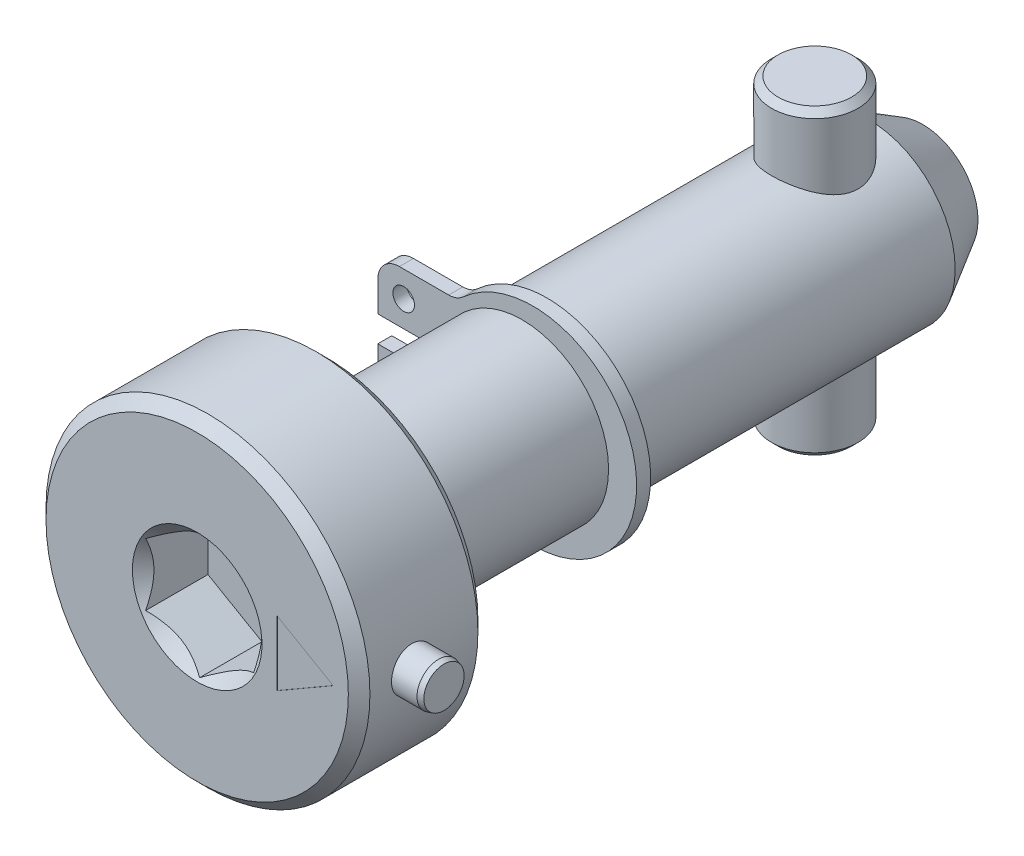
ISO-10303-21;
HEADER;
FILE_DESCRIPTION(('STEP AP214'),'2;1');
FILE_NAME('part.step','',(''),(''),'','','');
FILE_SCHEMA(('AUTOMOTIVE_DESIGN { 1 0 10303 214 1 1 1 1 }'));
ENDSEC;
DATA;
#1=APPLICATION_CONTEXT('core data for automotive mechanical design processes');
#2=APPLICATION_PROTOCOL_DEFINITION('international standard','automotive_design',2000,#1);
#3=PRODUCT_CONTEXT('',#1,'mechanical');
#4=PRODUCT('Part','Part','',(#3));
#5=PRODUCT_RELATED_PRODUCT_CATEGORY('part','',(#4));
#6=PRODUCT_DEFINITION_FORMATION('','',#4);
#7=PRODUCT_DEFINITION_CONTEXT('part definition',#1,'design');
#8=PRODUCT_DEFINITION('design','',#6,#7);
#9=PRODUCT_DEFINITION_SHAPE('','',#8);
#10=(LENGTH_UNIT() NAMED_UNIT(*) SI_UNIT(.MILLI.,.METRE.));
#11=(NAMED_UNIT(*) PLANE_ANGLE_UNIT() SI_UNIT($,.RADIAN.));
#12=(NAMED_UNIT(*) SI_UNIT($,.STERADIAN.) SOLID_ANGLE_UNIT());
#13=UNCERTAINTY_MEASURE_WITH_UNIT(LENGTH_MEASURE(1.E-05),#10,'distance_accuracy_value','');
#14=(GEOMETRIC_REPRESENTATION_CONTEXT(3) GLOBAL_UNCERTAINTY_ASSIGNED_CONTEXT((#13)) GLOBAL_UNIT_ASSIGNED_CONTEXT((#10,
#11,#12)) REPRESENTATION_CONTEXT('',''));
#15=CARTESIAN_POINT('',(0.,0.,0.));
#16=DIRECTION('',(0.,0.,1.));
#17=DIRECTION('',(1.,0.,0.));
#18=AXIS2_PLACEMENT_3D('',#15,#16,#17);
#19=CARTESIAN_POINT('',(0.,-2.88675134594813,7.67));
#20=DIRECTION('',(0.,0.,1.));
#21=DIRECTION('',(-1.,0.,0.));
#22=AXIS2_PLACEMENT_3D('',#19,#20,#21);
#23=PLANE('',#22);
#24=DIRECTION('',(0.866025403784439,-0.5,0.));
#25=VECTOR('',#24,1.);
#26=CARTESIAN_POINT('',(-2.5,-1.44337567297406,7.67));
#27=LINE('',#26,#25);
#28=CARTESIAN_POINT('',(-2.5,-1.44337567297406,7.67));
#29=VERTEX_POINT('',#28);
#30=CARTESIAN_POINT('',(0.,-2.88675134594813,7.67));
#31=VERTEX_POINT('',#30);
#32=EDGE_CURVE('E577',#29,#31,#27,.T.);
#33=ORIENTED_EDGE('',*,*,#32,.T.);
#34=DIRECTION('',(0.866025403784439,0.5,0.));
#35=VECTOR('',#34,1.);
#36=CARTESIAN_POINT('',(0.,-2.88675134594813,7.67));
#37=LINE('',#36,#35);
#38=CARTESIAN_POINT('',(2.5,-1.44337567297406,7.67));
#39=VERTEX_POINT('',#38);
#40=EDGE_CURVE('E730',#31,#39,#37,.T.);
#41=ORIENTED_EDGE('',*,*,#40,.T.);
#42=DIRECTION('',(0.,1.,0.));
#43=VECTOR('',#42,1.);
#44=CARTESIAN_POINT('',(2.5,-1.44337567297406,7.67));
#45=LINE('',#44,#43);
#46=CARTESIAN_POINT('',(2.5,1.44337567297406,7.67));
#47=VERTEX_POINT('',#46);
#48=EDGE_CURVE('E711',#39,#47,#45,.T.);
#49=ORIENTED_EDGE('',*,*,#48,.T.);
#50=DIRECTION('',(-0.866025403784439,0.5,0.));
#51=VECTOR('',#50,1.);
#52=CARTESIAN_POINT('',(2.5,1.44337567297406,7.67));
#53=LINE('',#52,#51);
#54=CARTESIAN_POINT('',(0.,2.88675134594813,7.67));
#55=VERTEX_POINT('',#54);
#56=EDGE_CURVE('E727',#47,#55,#53,.T.);
#57=ORIENTED_EDGE('',*,*,#56,.T.);
#58=DIRECTION('',(-0.866025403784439,-0.5,0.));
#59=VECTOR('',#58,1.);
#60=CARTESIAN_POINT('',(0.,2.88675134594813,7.67));
#61=LINE('',#60,#59);
#62=CARTESIAN_POINT('',(-2.5,1.44337567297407,7.67));
#63=VERTEX_POINT('',#62);
#64=EDGE_CURVE('E724',#55,#63,#61,.T.);
#65=ORIENTED_EDGE('',*,*,#64,.T.);
#66=DIRECTION('',(0.,-1.,0.));
#67=VECTOR('',#66,1.);
#68=CARTESIAN_POINT('',(-2.5,1.44337567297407,7.67));
#69=LINE('',#68,#67);
#70=EDGE_CURVE('E716',#63,#29,#69,.T.);
#71=ORIENTED_EDGE('',*,*,#70,.T.);
#72=EDGE_LOOP('',(#33,#41,#49,#57,#65,#71));
#73=FACE_BOUND('',#72,.T.);
#74=ADVANCED_FACE('F14',(#73),#23,.T.);
#75=CARTESIAN_POINT('',(-2.5,-1.44337567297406,7.67));
#76=DIRECTION('',(-0.5,-0.866025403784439,0.));
#77=DIRECTION('',(0.866025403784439,-0.5,0.));
#78=AXIS2_PLACEMENT_3D('',#75,#76,#77);
#79=PLANE('',#78);
#80=DIRECTION('',(0.,0.,1.));
#81=VECTOR('',#80,1.);
#82=CARTESIAN_POINT('',(-2.5,-1.44337567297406,7.67));
#83=LINE('',#82,#81);
#84=CARTESIAN_POINT('',(-2.5,-1.44337567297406,10.5567513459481));
#85=VERTEX_POINT('',#84);
#86=EDGE_CURVE('E595',#29,#85,#83,.T.);
#87=ORIENTED_EDGE('',*,*,#86,.T.);
#88=CARTESIAN_POINT('',(-2.5002,-1.44326020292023,10.5568668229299));
#89=CARTESIAN_POINT('',(-2.41426172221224,-1.49287669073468,10.5072920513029));
#90=CARTESIAN_POINT('',(-2.32688643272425,-1.54332283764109,10.4606288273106));
#91=CARTESIAN_POINT('',(-2.14871854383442,-1.64618811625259,10.3751894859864));
#92=CARTESIAN_POINT('',(-2.05790899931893,-1.69861703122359,10.3364609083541));
#93=CARTESIAN_POINT('',(-1.87479587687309,-1.80433744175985,10.2701180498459));
#94=CARTESIAN_POINT('',(-1.78253893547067,-1.85760201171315,10.242337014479));
#95=CARTESIAN_POINT('',(-1.59599399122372,-1.96530378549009,10.1995345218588));
#96=CARTESIAN_POINT('',(-1.50171168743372,-2.01973769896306,10.1844811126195));
#97=CARTESIAN_POINT('',(-1.33922174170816,-2.11355131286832,10.1708990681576));
#98=CARTESIAN_POINT('',(-1.27122403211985,-2.15280980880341,10.1688884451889));
#99=CARTESIAN_POINT('',(-1.13533975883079,-2.23126263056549,10.1722754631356));
#100=CARTESIAN_POINT('',(-1.06745324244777,-2.27045692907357,10.1776757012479));
#101=CARTESIAN_POINT('',(-0.932321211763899,-2.34847544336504,10.1955771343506));
#102=CARTESIAN_POINT('',(-0.865076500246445,-2.38729919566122,10.2080862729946));
#103=CARTESIAN_POINT('',(-0.731749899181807,-2.46427534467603,10.2395188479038));
#104=CARTESIAN_POINT('',(-0.665667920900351,-2.50242779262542,10.2584417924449));
#105=CARTESIAN_POINT('',(-0.496403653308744,-2.60015256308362,10.3146187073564));
#106=CARTESIAN_POINT('',(-0.394270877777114,-2.65911894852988,10.3561071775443));
#107=CARTESIAN_POINT('',(-0.244093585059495,-2.74582384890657,10.4261453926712));
#108=CARTESIAN_POINT('',(-0.194603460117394,-2.77439698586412,10.4507535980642));
#109=CARTESIAN_POINT('',(-0.0965399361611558,-2.83101398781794,10.5022132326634));
#110=CARTESIAN_POINT('',(-0.047965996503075,-2.85905816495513,10.5290632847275));
#111=CARTESIAN_POINT('',(0.000199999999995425,-2.88686681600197,10.5568668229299));
#112=B_SPLINE_CURVE_WITH_KNOTS('',3,(#88,#89,#90,#91,#92,#93,#94,#95,#96,#97,#98,#99,#100,#101,
#102,#103,#104,#105,#106,#107,#108,#109,#110,#111),.UNSPECIFIED.,.F.,.F.,(4,2,2,2,2,2,2,2,2,2,2,
4),(0.,0.333012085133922,0.667964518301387,0.99759703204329,1.32639954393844,1.56169424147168,
1.79707142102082,2.0327121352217,2.2683347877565,2.64260240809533,2.82922877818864,
3.01574133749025),.UNSPECIFIED.);
#113=CARTESIAN_POINT('',(0.,-2.88675134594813,10.5567513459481));
#114=VERTEX_POINT('',#113);
#115=EDGE_CURVE('E564',#85,#114,#112,.T.);
#116=ORIENTED_EDGE('',*,*,#115,.T.);
#117=DIRECTION('',(0.,0.,1.));
#118=VECTOR('',#117,1.);
#119=CARTESIAN_POINT('',(0.,-2.88675134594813,7.67));
#120=LINE('',#119,#118);
#121=EDGE_CURVE('E604',#31,#114,#120,.T.);
#122=ORIENTED_EDGE('',*,*,#121,.F.);
#123=ORIENTED_EDGE('',*,*,#32,.F.);
#124=EDGE_LOOP('',(#87,#116,#122,#123));
#125=FACE_BOUND('',#124,.T.);
#126=ADVANCED_FACE('F533',(#125),#79,.F.);
#127=CARTESIAN_POINT('',(0.,-2.88675134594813,7.67));
#128=DIRECTION('',(0.5,-0.866025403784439,0.));
#129=DIRECTION('',(0.866025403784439,0.5,0.));
#130=AXIS2_PLACEMENT_3D('',#127,#128,#129);
#131=PLANE('',#130);
#132=ORIENTED_EDGE('',*,*,#121,.T.);
#133=CARTESIAN_POINT('',(-0.000200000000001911,-2.88686681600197,10.5568668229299));
#134=CARTESIAN_POINT('',(0.0857382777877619,-2.83725032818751,10.5072920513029));
#135=CARTESIAN_POINT('',(0.17311356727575,-2.7868041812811,10.4606288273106));
#136=CARTESIAN_POINT('',(0.351281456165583,-2.68393890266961,10.3751894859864));
#137=CARTESIAN_POINT('',(0.442091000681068,-2.6315099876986,10.3364609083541));
#138=CARTESIAN_POINT('',(0.625204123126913,-2.52578957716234,10.2701180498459));
#139=CARTESIAN_POINT('',(0.717461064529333,-2.47252500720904,10.242337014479));
#140=CARTESIAN_POINT('',(0.904006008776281,-2.3648232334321,10.1995345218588));
#141=CARTESIAN_POINT('',(0.998288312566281,-2.31038931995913,10.1844811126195));
#142=CARTESIAN_POINT('',(1.16077825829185,-2.21657570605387,10.1708990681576));
#143=CARTESIAN_POINT('',(1.22877596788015,-2.17731721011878,10.1688884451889));
#144=CARTESIAN_POINT('',(1.36466024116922,-2.0988643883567,10.1722754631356));
#145=CARTESIAN_POINT('',(1.43254675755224,-2.05967008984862,10.1776757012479));
#146=CARTESIAN_POINT('',(1.56767878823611,-1.98165157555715,10.1955771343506));
#147=CARTESIAN_POINT('',(1.63492349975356,-1.94282782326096,10.2080862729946));
#148=CARTESIAN_POINT('',(1.7682501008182,-1.86585167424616,10.2395188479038));
#149=CARTESIAN_POINT('',(1.83433207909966,-1.82769922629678,10.2584417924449));
#150=CARTESIAN_POINT('',(2.00359634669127,-1.72997445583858,10.3146187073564));
#151=CARTESIAN_POINT('',(2.10572912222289,-1.67100807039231,10.3561071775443));
#152=CARTESIAN_POINT('',(2.25590641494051,-1.58430317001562,10.4261453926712));
#153=CARTESIAN_POINT('',(2.30539653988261,-1.55573003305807,10.4507535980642));
#154=CARTESIAN_POINT('',(2.40346006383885,-1.49911303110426,10.5022132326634));
#155=CARTESIAN_POINT('',(2.45203400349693,-1.47106885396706,10.5290632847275));
#156=CARTESIAN_POINT('',(2.5002,-1.44326020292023,10.5568668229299));
#157=B_SPLINE_CURVE_WITH_KNOTS('',3,(#133,#134,#135,#136,#137,#138,#139,#140,#141,#142,#143,
#144,#145,#146,#147,#148,#149,#150,#151,#152,#153,#154,#155,#156),.UNSPECIFIED.,.F.,.F.,(4,2,2,
2,2,2,2,2,2,2,2,4),(0.,0.333012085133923,0.66796451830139,0.997597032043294,1.32639954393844,
1.56169424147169,1.79707142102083,2.03271213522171,2.26833478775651,2.64260240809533,
2.82922877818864,3.01574133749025),.UNSPECIFIED.);
#158=CARTESIAN_POINT('',(2.5,-1.44337567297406,10.5567513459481));
#159=VERTEX_POINT('',#158);
#160=EDGE_CURVE('E624',#114,#159,#157,.T.);
#161=ORIENTED_EDGE('',*,*,#160,.T.);
#162=DIRECTION('',(0.,0.,1.));
#163=VECTOR('',#162,1.);
#164=CARTESIAN_POINT('',(2.5,-1.44337567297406,7.67));
#165=LINE('',#164,#163);
#166=EDGE_CURVE('E702',#39,#159,#165,.T.);
#167=ORIENTED_EDGE('',*,*,#166,.F.);
#168=ORIENTED_EDGE('',*,*,#40,.F.);
#169=EDGE_LOOP('',(#132,#161,#167,#168));
#170=FACE_BOUND('',#169,.T.);
#171=ADVANCED_FACE('F540',(#170),#131,.F.);
#172=CARTESIAN_POINT('',(2.5,-1.44337567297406,7.67));
#173=DIRECTION('',(1.,0.,0.));
#174=DIRECTION('',(0.,1.,0.));
#175=AXIS2_PLACEMENT_3D('',#172,#173,#174);
#176=PLANE('',#175);
#177=ORIENTED_EDGE('',*,*,#166,.T.);
#178=CARTESIAN_POINT('',(2.5,2.95728551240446,11.5424072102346));
#179=CARTESIAN_POINT('',(2.5,2.88562213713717,11.4876915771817));
#180=CARTESIAN_POINT('',(2.5,2.8135664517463,11.4334815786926));
#181=CARTESIAN_POINT('',(2.5,2.66851237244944,11.3263019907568));
#182=CARTESIAN_POINT('',(2.5,2.59551375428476,11.2733327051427));
#183=CARTESIAN_POINT('',(2.5,2.44788180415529,11.1684866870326));
#184=CARTESIAN_POINT('',(2.5,2.37324019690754,11.1166215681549));
#185=CARTESIAN_POINT('',(2.5,2.2227043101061,11.0147483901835));
#186=CARTESIAN_POINT('',(2.5,2.14681011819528,10.9647402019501));
#187=CARTESIAN_POINT('',(2.5,1.98889031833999,10.8640196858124));
#188=CARTESIAN_POINT('',(2.5,1.90677303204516,10.8134503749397));
#189=CARTESIAN_POINT('',(2.5,1.74063830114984,10.7155406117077));
#190=CARTESIAN_POINT('',(2.5,1.65662110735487,10.6681997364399));
#191=CARTESIAN_POINT('',(2.5,1.48664028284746,10.5777372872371));
#192=CARTESIAN_POINT('',(2.5,1.40068299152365,10.5346038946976));
#193=CARTESIAN_POINT('',(2.5,1.22637269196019,10.4535304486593));
#194=CARTESIAN_POINT('',(2.5,1.13802081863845,10.4155879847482));
#195=CARTESIAN_POINT('',(2.5,0.966951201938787,10.349432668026));
#196=CARTESIAN_POINT('',(2.5,0.884457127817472,10.320647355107));
#197=CARTESIAN_POINT('',(2.5,0.717414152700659,10.2696851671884));
#198=CARTESIAN_POINT('',(2.5,0.632865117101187,10.2475087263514));
#199=CARTESIAN_POINT('',(2.5,0.463662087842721,10.2113162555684));
#200=CARTESIAN_POINT('',(2.5,0.379039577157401,10.197155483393));
#201=CARTESIAN_POINT('',(2.5,0.208802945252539,10.1772818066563));
#202=CARTESIAN_POINT('',(2.5,0.123189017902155,10.1715672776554));
#203=CARTESIAN_POINT('',(2.5,-0.04469952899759,10.1690475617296));
#204=CARTESIAN_POINT('',(2.5,-0.12696895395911,10.171890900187));
#205=CARTESIAN_POINT('',(2.5,-0.290840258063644,10.1855351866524));
#206=CARTESIAN_POINT('',(2.5,-0.372442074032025,10.1963368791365));
#207=CARTESIAN_POINT('',(2.5,-0.535771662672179,10.2254787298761));
#208=CARTESIAN_POINT('',(2.5,-0.61747568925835,10.2439499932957));
#209=CARTESIAN_POINT('',(2.5,-0.779084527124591,10.2874255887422));
#210=CARTESIAN_POINT('',(2.5,-0.858989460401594,10.3124294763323));
#211=CARTESIAN_POINT('',(2.5,-1.10711347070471,10.3995668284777));
#212=CARTESIAN_POINT('',(2.5,-1.27191032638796,10.4714787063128));
#213=CARTESIAN_POINT('',(2.5,-1.51308713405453,10.5913993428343));
#214=CARTESIAN_POINT('',(2.5,-1.59262516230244,10.6334753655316));
#215=CARTESIAN_POINT('',(2.5,-1.7498982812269,10.7208793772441));
#216=CARTESIAN_POINT('',(2.5,-1.82763368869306,10.7662067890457));
#217=CARTESIAN_POINT('',(2.5,-1.97770400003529,10.8571510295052));
#218=CARTESIAN_POINT('',(2.5,-2.05011575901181,10.9026424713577));
#219=CARTESIAN_POINT('',(2.5,-2.19369710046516,10.995554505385));
#220=CARTESIAN_POINT('',(2.5,-2.26486658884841,11.0429752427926));
#221=CARTESIAN_POINT('',(2.5,-2.40555001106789,11.1390121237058));
#222=CARTESIAN_POINT('',(2.5,-2.47507266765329,11.1876155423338));
#223=CARTESIAN_POINT('',(2.5,-2.61316551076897,11.2861189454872));
#224=CARTESIAN_POINT('',(2.5,-2.68173595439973,11.3360185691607));
#225=CARTESIAN_POINT('',(2.5,-2.74990741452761,11.3864486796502));
#226=B_SPLINE_CURVE_WITH_KNOTS('',3,(#178,#179,#180,#181,#182,#183,#184,#185,#186,#187,#188,
#189,#190,#191,#192,#193,#194,#195,#196,#197,#198,#199,#200,#201,#202,#203,#204,#205,#206,#207,
#208,#209,#210,#211,#212,#213,#214,#215,#216,#217,#218,#219,#220,#221,#222,#223,#224,#225),
.UNSPECIFIED.,.F.,.F.,(4,2,2,2,2,2,2,2,2,2,2,2,2,2,2,2,2,2,2,2,2,2,2,4),(0.,0.270495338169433,
0.541056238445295,0.813709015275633,1.08634279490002,1.37560163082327,1.66482250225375,
1.95320604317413,2.24145521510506,2.50334359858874,2.7652491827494,3.02226079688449,
3.27922297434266,3.52577758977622,3.77235527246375,4.02333385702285,4.27429537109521,
4.81203557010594,5.08195798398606,5.35183259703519,5.60834857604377,5.86488390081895,
6.11935033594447,6.37374667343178),.UNSPECIFIED.);
#227=CARTESIAN_POINT('',(2.5,1.44337567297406,10.5567513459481));
#228=VERTEX_POINT('',#227);
#229=EDGE_CURVE('E708',#159,#228,#226,.F.);
#230=ORIENTED_EDGE('',*,*,#229,.T.);
#231=DIRECTION('',(0.,0.,1.));
#232=VECTOR('',#231,1.);
#233=CARTESIAN_POINT('',(2.5,1.44337567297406,7.67));
#234=LINE('',#233,#232);
#235=EDGE_CURVE('E713',#47,#228,#234,.T.);
#236=ORIENTED_EDGE('',*,*,#235,.F.);
#237=ORIENTED_EDGE('',*,*,#48,.F.);
#238=EDGE_LOOP('',(#177,#230,#236,#237));
#239=FACE_BOUND('',#238,.T.);
#240=ADVANCED_FACE('F707',(#239),#176,.F.);
#241=CARTESIAN_POINT('',(2.5,1.44337567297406,7.67));
#242=DIRECTION('',(0.5,0.866025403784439,0.));
#243=DIRECTION('',(-0.866025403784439,0.5,0.));
#244=AXIS2_PLACEMENT_3D('',#241,#242,#243);
#245=PLANE('',#244);
#246=ORIENTED_EDGE('',*,*,#235,.T.);
#247=CARTESIAN_POINT('',(2.5002,1.44326020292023,10.5568668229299));
#248=CARTESIAN_POINT('',(2.41426172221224,1.49287669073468,10.5072920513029));
#249=CARTESIAN_POINT('',(2.32688643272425,1.5433228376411,10.4606288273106));
#250=CARTESIAN_POINT('',(2.14871854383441,1.64618811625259,10.3751894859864));
#251=CARTESIAN_POINT('',(2.05790899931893,1.69861703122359,10.3364609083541));
#252=CARTESIAN_POINT('',(1.87479587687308,1.80433744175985,10.2701180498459));
#253=CARTESIAN_POINT('',(1.78253893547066,1.85760201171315,10.242337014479));
#254=CARTESIAN_POINT('',(1.59599399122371,1.96530378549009,10.1995345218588));
#255=CARTESIAN_POINT('',(1.50171168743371,2.01973769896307,10.1844811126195));
#256=CARTESIAN_POINT('',(1.33922174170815,2.11355131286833,10.1708990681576));
#257=CARTESIAN_POINT('',(1.27122403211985,2.15280980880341,10.1688884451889));
#258=CARTESIAN_POINT('',(1.13533975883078,2.23126263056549,10.1722754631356));
#259=CARTESIAN_POINT('',(1.06745324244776,2.27045692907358,10.177675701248));
#260=CARTESIAN_POINT('',(0.932321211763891,2.34847544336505,10.1955771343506));
#261=CARTESIAN_POINT('',(0.865076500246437,2.38729919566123,10.2080862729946));
#262=CARTESIAN_POINT('',(0.731749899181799,2.46427534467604,10.2395188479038));
#263=CARTESIAN_POINT('',(0.66566792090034,2.50242779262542,10.2584417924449));
#264=CARTESIAN_POINT('',(0.496403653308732,2.60015256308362,10.3146187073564));
#265=CARTESIAN_POINT('',(0.394270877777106,2.65911894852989,10.3561071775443));
#266=CARTESIAN_POINT('',(0.24409358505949,2.74582384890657,10.4261453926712));
#267=CARTESIAN_POINT('',(0.194603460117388,2.77439698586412,10.4507535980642));
#268=CARTESIAN_POINT('',(0.0965399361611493,2.83101398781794,10.5022132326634));
#269=CARTESIAN_POINT('',(0.0479659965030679,2.85905816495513,10.5290632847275));
#270=CARTESIAN_POINT('',(-0.000200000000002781,2.88686681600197,10.5568668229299));
#271=B_SPLINE_CURVE_WITH_KNOTS('',3,(#247,#248,#249,#250,#251,#252,#253,#254,#255,#256,#257,
#258,#259,#260,#261,#262,#263,#264,#265,#266,#267,#268,#269,#270),.UNSPECIFIED.,.F.,.F.,(4,2,2,
2,2,2,2,2,2,2,2,4),(0.,0.333012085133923,0.667964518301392,0.997597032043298,1.32639954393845,
1.56169424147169,1.79707142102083,2.03271213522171,2.26833478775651,2.64260240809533,
2.82922877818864,3.01574133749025),.UNSPECIFIED.);
#272=CARTESIAN_POINT('',(0.,2.88675134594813,10.5567513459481));
#273=VERTEX_POINT('',#272);
#274=EDGE_CURVE('E740',#228,#273,#271,.T.);
#275=ORIENTED_EDGE('',*,*,#274,.T.);
#276=DIRECTION('',(0.,0.,1.));
#277=VECTOR('',#276,1.);
#278=CARTESIAN_POINT('',(0.,2.88675134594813,7.67));
#279=LINE('',#278,#277);
#280=EDGE_CURVE('E714',#55,#273,#279,.T.);
#281=ORIENTED_EDGE('',*,*,#280,.F.);
#282=ORIENTED_EDGE('',*,*,#56,.F.);
#283=EDGE_LOOP('',(#246,#275,#281,#282));
#284=FACE_BOUND('',#283,.T.);
#285=ADVANCED_FACE('F738',(#284),#245,.F.);
#286=CARTESIAN_POINT('',(0.,2.88675134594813,7.67));
#287=DIRECTION('',(-0.5,0.866025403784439,0.));
#288=DIRECTION('',(-0.866025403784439,-0.5,0.));
#289=AXIS2_PLACEMENT_3D('',#286,#287,#288);
#290=PLANE('',#289);
#291=ORIENTED_EDGE('',*,*,#280,.T.);
#292=CARTESIAN_POINT('',(0.000199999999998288,2.88686681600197,10.5568668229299));
#293=CARTESIAN_POINT('',(-0.085738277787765,2.83725032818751,10.5072920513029));
#294=CARTESIAN_POINT('',(-0.173113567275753,2.7868041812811,10.4606288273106));
#295=CARTESIAN_POINT('',(-0.351281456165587,2.68393890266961,10.3751894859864));
#296=CARTESIAN_POINT('',(-0.442091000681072,2.6315099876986,10.3364609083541));
#297=CARTESIAN_POINT('',(-0.625204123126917,2.52578957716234,10.2701180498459));
#298=CARTESIAN_POINT('',(-0.717461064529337,2.47252500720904,10.242337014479));
#299=CARTESIAN_POINT('',(-0.904006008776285,2.3648232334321,10.1995345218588));
#300=CARTESIAN_POINT('',(-0.998288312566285,2.31038931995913,10.1844811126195));
#301=CARTESIAN_POINT('',(-1.16077825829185,2.21657570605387,10.1708990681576));
#302=CARTESIAN_POINT('',(-1.22877596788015,2.17731721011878,10.1688884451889));
#303=CARTESIAN_POINT('',(-1.36466024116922,2.0988643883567,10.1722754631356));
#304=CARTESIAN_POINT('',(-1.43254675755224,2.05967008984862,10.177675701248));
#305=CARTESIAN_POINT('',(-1.56767878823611,1.98165157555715,10.1955771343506));
#306=CARTESIAN_POINT('',(-1.63492349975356,1.94282782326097,10.2080862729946));
#307=CARTESIAN_POINT('',(-1.7682501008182,1.86585167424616,10.2395188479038));
#308=CARTESIAN_POINT('',(-1.83433207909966,1.82769922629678,10.2584417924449));
#309=CARTESIAN_POINT('',(-2.00359634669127,1.72997445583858,10.3146187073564));
#310=CARTESIAN_POINT('',(-2.10572912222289,1.67100807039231,10.3561071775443));
#311=CARTESIAN_POINT('',(-2.25590641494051,1.58430317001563,10.4261453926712));
#312=CARTESIAN_POINT('',(-2.30539653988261,1.55573003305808,10.4507535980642));
#313=CARTESIAN_POINT('',(-2.40346006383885,1.49911303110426,10.5022132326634));
#314=CARTESIAN_POINT('',(-2.45203400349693,1.47106885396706,10.5290632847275));
#315=CARTESIAN_POINT('',(-2.5002,1.44326020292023,10.5568668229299));
#316=B_SPLINE_CURVE_WITH_KNOTS('',3,(#292,#293,#294,#295,#296,#297,#298,#299,#300,#301,#302,
#303,#304,#305,#306,#307,#308,#309,#310,#311,#312,#313,#314,#315),.UNSPECIFIED.,.F.,.F.,(4,2,2,
2,2,2,2,2,2,2,2,4),(0.,0.333012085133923,0.667964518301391,0.997597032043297,1.32639954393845,
1.56169424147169,1.79707142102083,2.03271213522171,2.2683347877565,2.64260240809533,
2.82922877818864,3.01574133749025),.UNSPECIFIED.);
#317=CARTESIAN_POINT('',(-2.5,1.44337567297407,10.5567513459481));
#318=VERTEX_POINT('',#317);
#319=EDGE_CURVE('E565',#273,#318,#316,.T.);
#320=ORIENTED_EDGE('',*,*,#319,.T.);
#321=DIRECTION('',(0.,0.,1.));
#322=VECTOR('',#321,1.);
#323=CARTESIAN_POINT('',(-2.5,1.44337567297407,7.67));
#324=LINE('',#323,#322);
#325=EDGE_CURVE('E601',#63,#318,#324,.T.);
#326=ORIENTED_EDGE('',*,*,#325,.F.);
#327=ORIENTED_EDGE('',*,*,#64,.F.);
#328=EDGE_LOOP('',(#291,#320,#326,#327));
#329=FACE_BOUND('',#328,.T.);
#330=ADVANCED_FACE('F551',(#329),#290,.F.);
#331=CARTESIAN_POINT('',(-2.5,1.44337567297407,7.67));
#332=DIRECTION('',(-1.,0.,0.));
#333=DIRECTION('',(0.,-1.,0.));
#334=AXIS2_PLACEMENT_3D('',#331,#332,#333);
#335=PLANE('',#334);
#336=ORIENTED_EDGE('',*,*,#325,.T.);
#337=CARTESIAN_POINT('',(-2.5,2.95728551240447,11.5424072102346));
#338=CARTESIAN_POINT('',(-2.5,2.88562213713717,11.4876915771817));
#339=CARTESIAN_POINT('',(-2.5,2.81356645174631,11.4334815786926));
#340=CARTESIAN_POINT('',(-2.5,2.66851237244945,11.3263019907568));
#341=CARTESIAN_POINT('',(-2.5,2.59551375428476,11.2733327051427));
#342=CARTESIAN_POINT('',(-2.5,2.44788180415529,11.1684866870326));
#343=CARTESIAN_POINT('',(-2.5,2.37324019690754,11.1166215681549));
#344=CARTESIAN_POINT('',(-2.5,2.2227043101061,11.0147483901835));
#345=CARTESIAN_POINT('',(-2.5,2.14681011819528,10.9647402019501));
#346=CARTESIAN_POINT('',(-2.5,1.98889031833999,10.8640196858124));
#347=CARTESIAN_POINT('',(-2.5,1.90677303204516,10.8134503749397));
#348=CARTESIAN_POINT('',(-2.5,1.74063830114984,10.7155406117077));
#349=CARTESIAN_POINT('',(-2.5,1.65662110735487,10.6681997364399));
#350=CARTESIAN_POINT('',(-2.5,1.48664028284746,10.5777372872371));
#351=CARTESIAN_POINT('',(-2.5,1.40068299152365,10.5346038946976));
#352=CARTESIAN_POINT('',(-2.5,1.22637269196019,10.4535304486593));
#353=CARTESIAN_POINT('',(-2.5,1.13802081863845,10.4155879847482));
#354=CARTESIAN_POINT('',(-2.5,0.966951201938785,10.349432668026));
#355=CARTESIAN_POINT('',(-2.5,0.884457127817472,10.3206473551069));
#356=CARTESIAN_POINT('',(-2.5,0.717414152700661,10.2696851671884));
#357=CARTESIAN_POINT('',(-2.5,0.632865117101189,10.2475087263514));
#358=CARTESIAN_POINT('',(-2.5,0.463662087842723,10.2113162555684));
#359=CARTESIAN_POINT('',(-2.5,0.379039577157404,10.197155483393));
#360=CARTESIAN_POINT('',(-2.5,0.208802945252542,10.1772818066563));
#361=CARTESIAN_POINT('',(-2.5,0.123189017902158,10.1715672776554));
#362=CARTESIAN_POINT('',(-2.5,-0.0446995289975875,10.1690475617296));
#363=CARTESIAN_POINT('',(-2.5,-0.126968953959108,10.171890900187));
#364=CARTESIAN_POINT('',(-2.5,-0.290840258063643,10.1855351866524));
#365=CARTESIAN_POINT('',(-2.5,-0.372442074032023,10.1963368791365));
#366=CARTESIAN_POINT('',(-2.5,-0.535771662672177,10.2254787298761));
#367=CARTESIAN_POINT('',(-2.5,-0.617475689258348,10.2439499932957));
#368=CARTESIAN_POINT('',(-2.5,-0.779084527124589,10.2874255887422));
#369=CARTESIAN_POINT('',(-2.5,-0.858989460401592,10.3124294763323));
#370=CARTESIAN_POINT('',(-2.5,-1.1071134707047,10.3995668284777));
#371=CARTESIAN_POINT('',(-2.5,-1.27191032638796,10.4714787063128));
#372=CARTESIAN_POINT('',(-2.5,-1.51308713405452,10.5913993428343));
#373=CARTESIAN_POINT('',(-2.5,-1.59262516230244,10.6334753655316));
#374=CARTESIAN_POINT('',(-2.5,-1.7498982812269,10.7208793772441));
#375=CARTESIAN_POINT('',(-2.5,-1.82763368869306,10.7662067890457));
#376=CARTESIAN_POINT('',(-2.5,-1.97770400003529,10.8571510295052));
#377=CARTESIAN_POINT('',(-2.5,-2.05011575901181,10.9026424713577));
#378=CARTESIAN_POINT('',(-2.5,-2.19369710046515,10.995554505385));
#379=CARTESIAN_POINT('',(-2.5,-2.2648665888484,11.0429752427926));
#380=CARTESIAN_POINT('',(-2.5,-2.40555001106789,11.1390121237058));
#381=CARTESIAN_POINT('',(-2.5,-2.47507266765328,11.1876155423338));
#382=CARTESIAN_POINT('',(-2.5,-2.61316551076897,11.2861189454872));
#383=CARTESIAN_POINT('',(-2.5,-2.68173595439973,11.3360185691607));
#384=CARTESIAN_POINT('',(-2.5,-2.7499074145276,11.3864486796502));
#385=B_SPLINE_CURVE_WITH_KNOTS('',3,(#337,#338,#339,#340,#341,#342,#343,#344,#345,#346,#347,
#348,#349,#350,#351,#352,#353,#354,#355,#356,#357,#358,#359,#360,#361,#362,#363,#364,#365,#366,
#367,#368,#369,#370,#371,#372,#373,#374,#375,#376,#377,#378,#379,#380,#381,#382,#383,#384),
.UNSPECIFIED.,.F.,.F.,(4,2,2,2,2,2,2,2,2,2,2,2,2,2,2,2,2,2,2,2,2,2,2,4),(0.,0.270495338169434,
0.541056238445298,0.813709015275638,1.08634279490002,1.37560163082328,1.66482250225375,
1.95320604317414,2.24145521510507,2.50334359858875,2.7652491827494,3.02226079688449,
3.27922297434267,3.52577758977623,3.77235527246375,4.02333385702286,4.27429537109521,
4.81203557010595,5.08195798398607,5.3518325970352,5.60834857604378,5.86488390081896,
6.11935033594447,6.37374667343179),.UNSPECIFIED.);
#386=EDGE_CURVE('E556',#318,#85,#385,.T.);
#387=ORIENTED_EDGE('',*,*,#386,.T.);
#388=ORIENTED_EDGE('',*,*,#86,.F.);
#389=ORIENTED_EDGE('',*,*,#70,.F.);
#390=EDGE_LOOP('',(#336,#387,#388,#389));
#391=FACE_BOUND('',#390,.T.);
#392=ADVANCED_FACE('F390',(#391),#335,.F.);
#393=CARTESIAN_POINT('',(8.92862844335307,0.,8.17));
#394=DIRECTION('',(-1.,0.,0.));
#395=DIRECTION('',(0.,0.646146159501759,0.763213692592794));
#396=AXIS2_PLACEMENT_3D('',#393,#394,#395);
#397=PLANE('',#396);
#398=CARTESIAN_POINT('',(8.92862844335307,0.,8.17));
#399=DIRECTION('',(-1.,0.,0.));
#400=DIRECTION('',(0.,0.646146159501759,0.763213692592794));
#401=AXIS2_PLACEMENT_3D('',#398,#399,#400);
#402=CIRCLE('',#401,0.93301270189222);
#403=CARTESIAN_POINT('',(8.92862844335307,0.602862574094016,8.88208806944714));
#404=VERTEX_POINT('',#403);
#405=EDGE_CURVE('E18',#404,#404,#402,.F.);
#406=ORIENTED_EDGE('',*,*,#405,.T.);
#407=EDGE_LOOP('',(#406));
#408=FACE_BOUND('',#407,.T.);
#409=ADVANCED_FACE('F387',(#408),#397,.F.);
#410=CARTESIAN_POINT('',(0.,0.,10.67));
#411=DIRECTION('',(0.,0.,1.));
#412=DIRECTION('',(-1.,0.,0.));
#413=AXIS2_PLACEMENT_3D('',#410,#411,#412);
#414=PLANE('',#413);
#415=DIRECTION('',(0.,-1.,0.));
#416=VECTOR('',#415,1.);
#417=CARTESIAN_POINT('',(3.7,-1.5,10.67));
#418=LINE('',#417,#416);
#419=CARTESIAN_POINT('',(3.7,1.5,10.67));
#420=VERTEX_POINT('',#419);
#421=CARTESIAN_POINT('',(3.7,-1.5,10.67));
#422=VERTEX_POINT('',#421);
#423=EDGE_CURVE('E259',#420,#422,#418,.T.);
#424=ORIENTED_EDGE('',*,*,#423,.F.);
#425=DIRECTION('',(-0.866025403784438,0.5,0.));
#426=VECTOR('',#425,1.);
#427=CARTESIAN_POINT('',(3.7,1.5,10.67));
#428=LINE('',#427,#426);
#429=CARTESIAN_POINT('',(6.29807621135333,0.,10.67));
#430=VERTEX_POINT('',#429);
#431=EDGE_CURVE('E893',#430,#420,#428,.T.);
#432=ORIENTED_EDGE('',*,*,#431,.F.);
#433=DIRECTION('',(0.866025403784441,0.5,0.));
#434=VECTOR('',#433,1.);
#435=CARTESIAN_POINT('',(6.29807621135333,0.,10.67));
#436=LINE('',#435,#434);
#437=EDGE_CURVE('E31',#422,#430,#436,.T.);
#438=ORIENTED_EDGE('',*,*,#437,.F.);
#439=EDGE_LOOP('',(#424,#432,#438));
#440=FACE_BOUND('',#439,.T.);
#441=CARTESIAN_POINT('',(0.,0.,10.67));
#442=DIRECTION('',(0.,0.,1.));
#443=DIRECTION('',(-1.,0.,0.));
#444=AXIS2_PLACEMENT_3D('',#441,#442,#443);
#445=CIRCLE('',#444,3.);
#446=CARTESIAN_POINT('',(-3.,0.,10.67));
#447=VERTEX_POINT('',#446);
#448=EDGE_CURVE('E237',#447,#447,#445,.T.);
#449=ORIENTED_EDGE('',*,*,#448,.F.);
#450=EDGE_LOOP('',(#449));
#451=FACE_BOUND('',#450,.T.);
#452=CARTESIAN_POINT('',(0.,0.,10.67));
#453=DIRECTION('',(0.,0.,1.));
#454=DIRECTION('',(-1.,0.,0.));
#455=AXIS2_PLACEMENT_3D('',#452,#453,#454);
#456=CIRCLE('',#455,7.);
#457=CARTESIAN_POINT('',(-7.,0.,10.67));
#458=VERTEX_POINT('',#457);
#459=EDGE_CURVE('E621',#458,#458,#456,.T.);
#460=ORIENTED_EDGE('',*,*,#459,.T.);
#461=EDGE_LOOP('',(#460));
#462=FACE_BOUND('',#461,.T.);
#463=ADVANCED_FACE('F368',(#440,#451,#462),#414,.T.);
#464=CARTESIAN_POINT('',(0.,0.,10.67));
#465=DIRECTION('',(0.,0.,1.));
#466=DIRECTION('',(-1.,0.,0.));
#467=AXIS2_PLACEMENT_3D('',#464,#465,#466);
#468=CONICAL_SURFACE('',#467,3.,0.78539816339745);
#469=ORIENTED_EDGE('',*,*,#448,.T.);
#470=EDGE_LOOP('',(#469));
#471=FACE_BOUND('',#470,.T.);
#472=ORIENTED_EDGE('',*,*,#386,.F.);
#473=ORIENTED_EDGE('',*,*,#319,.F.);
#474=ORIENTED_EDGE('',*,*,#274,.F.);
#475=ORIENTED_EDGE('',*,*,#229,.F.);
#476=ORIENTED_EDGE('',*,*,#160,.F.);
#477=ORIENTED_EDGE('',*,*,#115,.F.);
#478=EDGE_LOOP('',(#472,#473,#474,#475,#476,#477));
#479=FACE_BOUND('',#478,.T.);
#480=ADVANCED_FACE('F546',(#471,#479),#468,.F.);
#481=CARTESIAN_POINT('',(8.67862844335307,0.,8.17));
#482=DIRECTION('',(-1.,0.,0.));
#483=DIRECTION('',(0.,0.646146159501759,0.763213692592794));
#484=AXIS2_PLACEMENT_3D('',#481,#482,#483);
#485=CONICAL_SURFACE('',#484,1.,0.261799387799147);
#486=ORIENTED_EDGE('',*,*,#405,.F.);
#487=EDGE_LOOP('',(#486));
#488=FACE_BOUND('',#487,.T.);
#489=CARTESIAN_POINT('',(8.67862844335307,0.,8.17));
#490=DIRECTION('',(-1.,0.,0.));
#491=DIRECTION('',(0.,0.646146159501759,0.763213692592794));
#492=AXIS2_PLACEMENT_3D('',#489,#490,#491);
#493=CIRCLE('',#492,1.);
#494=CARTESIAN_POINT('',(8.67862844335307,0.646146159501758,8.93321369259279));
#495=VERTEX_POINT('',#494);
#496=EDGE_CURVE('E238',#495,#495,#493,.T.);
#497=ORIENTED_EDGE('',*,*,#496,.F.);
#498=EDGE_LOOP('',(#497));
#499=FACE_BOUND('',#498,.T.);
#500=ADVANCED_FACE('F16',(#488,#499),#485,.T.);
#501=CARTESIAN_POINT('',(3.92862844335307,0.,8.17));
#502=DIRECTION('',(1.,0.,0.));
#503=DIRECTION('',(0.,-0.646146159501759,-0.763213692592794));
#504=AXIS2_PLACEMENT_3D('',#501,#502,#503);
#505=CYLINDRICAL_SURFACE('',#504,1.);
#506=CARTESIAN_POINT('',(7.5,0.,9.17));
#507=CARTESIAN_POINT('',(7.49999917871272,0.0559044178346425,9.16999764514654));
#508=CARTESIAN_POINT('',(7.49936835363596,0.111842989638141,9.16529623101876));
#509=CARTESIAN_POINT('',(7.49691255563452,0.22216136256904,9.14661682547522));
#510=CARTESIAN_POINT('',(7.49508636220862,0.276539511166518,9.13262935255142));
#511=CARTESIAN_POINT('',(7.49044539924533,0.382124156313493,9.09579914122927));
#512=CARTESIAN_POINT('',(7.48763132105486,0.43333284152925,9.07296259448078));
#513=CARTESIAN_POINT('',(7.48132693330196,0.531181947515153,9.01909654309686));
#514=CARTESIAN_POINT('',(7.47783673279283,0.577823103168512,8.98806835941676));
#515=CARTESIAN_POINT('',(7.47054497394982,0.665512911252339,8.9184933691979));
#516=CARTESIAN_POINT('',(7.46674179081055,0.706528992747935,8.87990567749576));
#517=CARTESIAN_POINT('',(7.45926568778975,0.781523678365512,8.79639490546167));
#518=CARTESIAN_POINT('',(7.45559277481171,0.815501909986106,8.75147149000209));
#519=CARTESIAN_POINT('',(7.44877717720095,0.875579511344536,8.65635043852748));
#520=CARTESIAN_POINT('',(7.44563658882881,0.901648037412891,8.60613315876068));
#521=CARTESIAN_POINT('',(7.44026293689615,0.944969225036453,8.5019844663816));
#522=CARTESIAN_POINT('',(7.43802983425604,0.962222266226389,8.44805321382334));
#523=CARTESIAN_POINT('',(7.43473968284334,0.987323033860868,8.33834709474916));
#524=CARTESIAN_POINT('',(7.43367572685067,0.995226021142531,8.28258508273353));
#525=CARTESIAN_POINT('',(7.43282325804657,1.00157340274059,8.17051691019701));
#526=CARTESIAN_POINT('',(7.433034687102,1.00001822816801,8.11421077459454));
#527=CARTESIAN_POINT('',(7.43470277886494,0.98753872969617,8.00303943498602));
#528=CARTESIAN_POINT('',(7.43615132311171,0.976675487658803,7.94816723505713));
#529=CARTESIAN_POINT('',(7.44011776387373,0.945983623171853,7.84103158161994));
#530=CARTESIAN_POINT('',(7.44263568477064,0.926154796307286,7.78876818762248));
#531=CARTESIAN_POINT('',(7.44846630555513,0.878029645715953,7.68814518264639));
#532=CARTESIAN_POINT('',(7.45178147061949,0.849706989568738,7.63979831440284));
#533=CARTESIAN_POINT('',(7.45883118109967,0.785416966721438,7.54852045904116));
#534=CARTESIAN_POINT('',(7.46256574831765,0.749449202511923,7.5055897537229));
#535=CARTESIAN_POINT('',(7.47006949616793,0.67055245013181,7.42600849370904));
#536=CARTESIAN_POINT('',(7.47383871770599,0.627570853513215,7.38941007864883));
#537=CARTESIAN_POINT('',(7.48095961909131,0.536047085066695,7.3239389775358));
#538=CARTESIAN_POINT('',(7.48431129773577,0.487504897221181,7.29506631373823));
#539=CARTESIAN_POINT('',(7.49022196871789,0.386196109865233,7.24586544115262));
#540=CARTESIAN_POINT('',(7.49278063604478,0.33342778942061,7.22554073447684));
#541=CARTESIAN_POINT('',(7.49681412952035,0.225185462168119,7.19405534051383));
#542=CARTESIAN_POINT('',(7.49828901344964,0.169711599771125,7.18289416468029));
#543=CARTESIAN_POINT('',(7.49998120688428,0.0580834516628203,7.17012078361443));
#544=CARTESIAN_POINT('',(7.50020796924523,0.0019375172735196,7.16843679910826));
#545=CARTESIAN_POINT('',(7.49940395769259,-0.109835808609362,7.17447583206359));
#546=CARTESIAN_POINT('',(7.49837321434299,-0.165463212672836,7.18219862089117));
#547=CARTESIAN_POINT('',(7.4951758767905,-0.27440685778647,7.20677232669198));
#548=CARTESIAN_POINT('',(7.4930135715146,-0.32773100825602,7.22358878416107));
#549=CARTESIAN_POINT('',(7.48779504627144,-0.430802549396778,7.26583648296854));
#550=CARTESIAN_POINT('',(7.4847387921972,-0.480549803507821,7.29126805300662));
#551=CARTESIAN_POINT('',(7.47804918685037,-0.57537443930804,7.35019607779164));
#552=CARTESIAN_POINT('',(7.47441257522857,-0.620422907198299,7.38373868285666));
#553=CARTESIAN_POINT('',(7.46697864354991,-0.704276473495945,7.45787166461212));
#554=CARTESIAN_POINT('',(7.4631813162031,-0.743081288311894,7.49846236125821));
#555=CARTESIAN_POINT('',(7.45582451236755,-0.813602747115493,7.58585657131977));
#556=CARTESIAN_POINT('',(7.45226674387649,-0.84527163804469,7.63269878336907));
#557=CARTESIAN_POINT('',(7.44582066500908,-0.900291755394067,7.73107970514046));
#558=CARTESIAN_POINT('',(7.44293233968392,-0.923643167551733,7.78261830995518));
#559=CARTESIAN_POINT('',(7.43816405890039,-0.961289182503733,7.88877862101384));
#560=CARTESIAN_POINT('',(7.43628117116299,-0.975610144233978,7.9433908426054));
#561=CARTESIAN_POINT('',(7.43372874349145,-0.994873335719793,8.05427181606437));
#562=CARTESIAN_POINT('',(7.43305913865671,-0.999816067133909,8.11054047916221));
#563=CARTESIAN_POINT('',(7.43301115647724,-1.00017242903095,8.22266174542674));
#564=CARTESIAN_POINT('',(7.4336226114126,-0.995661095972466,8.27851412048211));
#565=CARTESIAN_POINT('',(7.43604591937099,-0.977396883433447,8.38865893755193));
#566=CARTESIAN_POINT('',(7.43785777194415,-0.963644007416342,8.44295138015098));
#567=CARTESIAN_POINT('',(7.44247445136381,-0.927311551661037,8.54842184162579));
#568=CARTESIAN_POINT('',(7.44527881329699,-0.90473610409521,8.59960130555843));
#569=CARTESIAN_POINT('',(7.45156522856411,-0.85140671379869,8.69745794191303));
#570=CARTESIAN_POINT('',(7.45504729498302,-0.820652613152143,8.74413502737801));
#571=CARTESIAN_POINT('',(7.46232983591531,-0.751562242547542,8.8320448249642));
#572=CARTESIAN_POINT('',(7.46613252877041,-0.713170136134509,8.87323347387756));
#573=CARTESIAN_POINT('',(7.47360859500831,-0.630010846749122,8.94861160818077));
#574=CARTESIAN_POINT('',(7.47728193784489,-0.585242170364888,8.98279944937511));
#575=CARTESIAN_POINT('',(7.48410317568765,-0.49037649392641,9.04333356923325));
#576=CARTESIAN_POINT('',(7.48724873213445,-0.440257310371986,9.06964533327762));
#577=CARTESIAN_POINT('',(7.49263660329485,-0.336296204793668,9.11344029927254));
#578=CARTESIAN_POINT('',(7.49487988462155,-0.282458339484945,9.13093295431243));
#579=CARTESIAN_POINT('',(7.49767860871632,-0.190294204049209,9.15247400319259));
#580=CARTESIAN_POINT('',(7.49854481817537,-0.152545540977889,9.15903662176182));
#581=CARTESIAN_POINT('',(7.49970579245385,-0.0765365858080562,9.16780040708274));
#582=CARTESIAN_POINT('',(7.500000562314,-0.0382762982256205,9.1700016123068));
#583=CARTESIAN_POINT('',(7.5,0.,9.17));
#584=B_SPLINE_CURVE_WITH_KNOTS('',3,(#506,#507,#508,#509,#510,#511,#512,#513,#514,#515,#516,
#517,#518,#519,#520,#521,#522,#523,#524,#525,#526,#527,#528,#529,#530,#531,#532,#533,#534,#535,
#536,#537,#538,#539,#540,#541,#542,#543,#544,#545,#546,#547,#548,#549,#550,#551,#552,#553,#554,
#555,#556,#557,#558,#559,#560,#561,#562,#563,#564,#565,#566,#567,#568,#569,#570,#571,#572,#573,
#574,#575,#576,#577,#578,#579,#580,#581,#582,#583),.UNSPECIFIED.,.T.,.F.,(4,2,2,2,2,2,2,2,2,2,2,
2,2,2,2,2,2,2,2,2,2,2,2,2,2,2,2,2,2,2,2,2,2,2,2,2,2,2,4),(0.,0.167573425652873,
0.335318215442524,0.502945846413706,0.670546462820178,0.839079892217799,1.00762223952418,
1.17681360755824,1.34599768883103,1.5141767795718,1.68234820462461,1.84942442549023,
2.01650445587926,2.1841079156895,2.35172009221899,2.52065272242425,2.68958583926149,
2.8585881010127,3.02758135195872,3.19529292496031,3.36300042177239,3.53007681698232,
3.69715958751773,3.86521637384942,4.03328079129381,4.20243852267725,4.37159247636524,
4.54025037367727,4.70889924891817,4.87621463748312,5.04352996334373,5.21076701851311,
5.37800730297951,5.54651833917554,5.7150689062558,5.88434763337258,6.0534445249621,
6.16817869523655,6.2829118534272),.UNSPECIFIED.);
#585=CARTESIAN_POINT('',(7.5,0.,9.17));
#586=VERTEX_POINT('',#585);
#587=EDGE_CURVE('E320',#586,#586,#584,.T.);
#588=ORIENTED_EDGE('',*,*,#587,.F.);
#589=EDGE_LOOP('',(#588));
#590=FACE_BOUND('',#589,.T.);
#591=ORIENTED_EDGE('',*,*,#496,.T.);
#592=EDGE_LOOP('',(#591));
#593=FACE_BOUND('',#592,.T.);
#594=ADVANCED_FACE('F381',(#590,#593),#505,.T.);
#595=CARTESIAN_POINT('',(0.,0.,10.17));
#596=DIRECTION('',(0.,0.,-1.));
#597=DIRECTION('',(1.,0.,0.));
#598=AXIS2_PLACEMENT_3D('',#595,#596,#597);
#599=CONICAL_SURFACE('',#598,7.5,0.785398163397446);
#600=ORIENTED_EDGE('',*,*,#459,.F.);
#601=EDGE_LOOP('',(#600));
#602=FACE_BOUND('',#601,.T.);
#603=CARTESIAN_POINT('',(0.,0.,10.17));
#604=DIRECTION('',(0.,0.,1.));
#605=DIRECTION('',(-1.,0.,0.));
#606=AXIS2_PLACEMENT_3D('',#603,#604,#605);
#607=CIRCLE('',#606,7.5);
#608=CARTESIAN_POINT('',(-7.5,0.,10.17));
#609=VERTEX_POINT('',#608);
#610=EDGE_CURVE('E615',#609,#609,#607,.F.);
#611=ORIENTED_EDGE('',*,*,#610,.F.);
#612=EDGE_LOOP('',(#611));
#613=FACE_BOUND('',#612,.T.);
#614=ADVANCED_FACE('F385',(#602,#613),#599,.T.);
#615=CARTESIAN_POINT('',(0.,0.,-22.93));
#616=DIRECTION('',(0.,0.,-1.));
#617=DIRECTION('',(1.,0.,0.));
#618=AXIS2_PLACEMENT_3D('',#615,#616,#617);
#619=CONICAL_SURFACE('',#618,1.75,0.78539816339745);
#620=CARTESIAN_POINT('',(0.,0.,-22.68));
#621=DIRECTION('',(0.,0.,-1.));
#622=DIRECTION('',(0.,-1.,0.));
#623=AXIS2_PLACEMENT_3D('',#620,#621,#622);
#624=CIRCLE('',#623,1.5);
#625=CARTESIAN_POINT('',(0.,-1.5,-22.68));
#626=VERTEX_POINT('',#625);
#627=EDGE_CURVE('E9',#626,#626,#624,.T.);
#628=ORIENTED_EDGE('',*,*,#627,.F.);
#629=EDGE_LOOP('',(#628));
#630=FACE_BOUND('',#629,.T.);
#631=CARTESIAN_POINT('',(0.,0.,-22.93));
#632=DIRECTION('',(0.,0.,-1.));
#633=DIRECTION('',(1.,0.,0.));
#634=AXIS2_PLACEMENT_3D('',#631,#632,#633);
#635=CIRCLE('',#634,1.75);
#636=CARTESIAN_POINT('',(1.75,0.,-22.93));
#637=VERTEX_POINT('',#636);
#638=EDGE_CURVE('E592',#637,#637,#635,.T.);
#639=ORIENTED_EDGE('',*,*,#638,.T.);
#640=EDGE_LOOP('',(#639));
#641=FACE_BOUND('',#640,.T.);
#642=ADVANCED_FACE('F366',(#630,#641),#619,.F.);
#643=CARTESIAN_POINT('',(0.,0.,-22.93));
#644=DIRECTION('',(0.,0.,-1.));
#645=DIRECTION('',(1.,0.,0.));
#646=AXIS2_PLACEMENT_3D('',#643,#644,#645);
#647=CYLINDRICAL_SURFACE('',#646,7.5);
#648=CARTESIAN_POINT('',(0.,0.,5.17));
#649=DIRECTION('',(0.,0.,-1.));
#650=DIRECTION('',(1.,0.,0.));
#651=AXIS2_PLACEMENT_3D('',#648,#649,#650);
#652=CIRCLE('',#651,7.5);
#653=CARTESIAN_POINT('',(7.5,0.,5.17));
#654=VERTEX_POINT('',#653);
#655=EDGE_CURVE('E618',#654,#654,#652,.F.);
#656=ORIENTED_EDGE('',*,*,#655,.T.);
#657=EDGE_LOOP('',(#656));
#658=FACE_BOUND('',#657,.T.);
#659=ORIENTED_EDGE('',*,*,#610,.T.);
#660=EDGE_LOOP('',(#659));
#661=FACE_BOUND('',#660,.T.);
#662=ORIENTED_EDGE('',*,*,#587,.T.);
#663=EDGE_LOOP('',(#662));
#664=FACE_BOUND('',#663,.T.);
#665=ADVANCED_FACE('F361',(#658,#661,#664),#647,.T.);
#666=CARTESIAN_POINT('',(-5.48701804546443,-1.50967391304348,-4.38));
#667=DIRECTION('',(0.,0.,-1.));
#668=DIRECTION('',(1.,0.,0.));
#669=AXIS2_PLACEMENT_3D('',#666,#667,#668);
#670=CYLINDRICAL_SURFACE('',#669,0.5);
#671=CARTESIAN_POINT('',(-5.48701804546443,-1.50967391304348,-4.38));
#672=DIRECTION('',(0.,0.,1.));
#673=DIRECTION('',(-1.,0.,0.));
#674=AXIS2_PLACEMENT_3D('',#671,#672,#673);
#675=CIRCLE('',#674,0.5);
#676=CARTESIAN_POINT('',(-5.98701804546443,-1.50967391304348,-4.38));
#677=VERTEX_POINT('',#676);
#678=EDGE_CURVE('E379',#677,#677,#675,.T.);
#679=ORIENTED_EDGE('',*,*,#678,.T.);
#680=EDGE_LOOP('',(#679));
#681=FACE_BOUND('',#680,.T.);
#682=CARTESIAN_POINT('',(-5.48701804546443,-1.50967391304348,-5.03));
#683=DIRECTION('',(0.,0.,1.));
#684=DIRECTION('',(-1.,0.,0.));
#685=AXIS2_PLACEMENT_3D('',#682,#683,#684);
#686=CIRCLE('',#685,0.5);
#687=CARTESIAN_POINT('',(-5.98701804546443,-1.50967391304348,-5.03));
#688=VERTEX_POINT('',#687);
#689=EDGE_CURVE('E244',#688,#688,#686,.T.);
#690=ORIENTED_EDGE('',*,*,#689,.F.);
#691=EDGE_LOOP('',(#690));
#692=FACE_BOUND('',#691,.T.);
#693=ADVANCED_FACE('F365',(#681,#692),#670,.F.);
#694=CARTESIAN_POINT('',(-6.68701804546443,0.890326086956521,-4.38));
#695=DIRECTION('',(1.,0.,0.));
#696=DIRECTION('',(0.,1.,0.));
#697=AXIS2_PLACEMENT_3D('',#694,#695,#696);
#698=PLANE('',#697);
#699=DIRECTION('',(0.,-1.,0.));
#700=VECTOR('',#699,1.);
#701=CARTESIAN_POINT('',(-6.68701804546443,0.890326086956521,-5.03));
#702=LINE('',#701,#700);
#703=CARTESIAN_POINT('',(-6.68701804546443,2.29032608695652,-5.03));
#704=VERTEX_POINT('',#703);
#705=CARTESIAN_POINT('',(-6.68701804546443,0.890326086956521,-5.03));
#706=VERTEX_POINT('',#705);
#707=EDGE_CURVE('E187',#704,#706,#702,.T.);
#708=ORIENTED_EDGE('',*,*,#707,.T.);
#709=DIRECTION('',(0.,0.,-1.));
#710=VECTOR('',#709,1.);
#711=CARTESIAN_POINT('',(-6.68701804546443,0.890326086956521,-4.38));
#712=LINE('',#711,#710);
#713=CARTESIAN_POINT('',(-6.68701804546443,0.890326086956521,-4.38));
#714=VERTEX_POINT('',#713);
#715=EDGE_CURVE('E233',#714,#706,#712,.T.);
#716=ORIENTED_EDGE('',*,*,#715,.F.);
#717=DIRECTION('',(0.,-1.,0.));
#718=VECTOR('',#717,1.);
#719=CARTESIAN_POINT('',(-6.68701804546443,0.890326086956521,-4.38));
#720=LINE('',#719,#718);
#721=CARTESIAN_POINT('',(-6.68701804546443,2.29032608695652,-4.38));
#722=VERTEX_POINT('',#721);
#723=EDGE_CURVE('E648',#722,#714,#720,.T.);
#724=ORIENTED_EDGE('',*,*,#723,.F.);
#725=DIRECTION('',(0.,0.,-1.));
#726=VECTOR('',#725,1.);
#727=CARTESIAN_POINT('',(-6.68701804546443,2.29032608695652,-4.38));
#728=LINE('',#727,#726);
#729=EDGE_CURVE('E236',#722,#704,#728,.T.);
#730=ORIENTED_EDGE('',*,*,#729,.T.);
#731=EDGE_LOOP('',(#708,#716,#724,#730));
#732=FACE_BOUND('',#731,.T.);
#733=ADVANCED_FACE('F394',(#732),#698,.F.);
#734=CARTESIAN_POINT('',(-5.68701804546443,2.29032608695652,-4.38));
#735=DIRECTION('',(0.,0.,-1.));
#736=DIRECTION('',(1.,0.,0.));
#737=AXIS2_PLACEMENT_3D('',#734,#735,#736);
#738=CYLINDRICAL_SURFACE('',#737,1.);
#739=CARTESIAN_POINT('',(-5.68701804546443,2.29032608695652,-5.03));
#740=DIRECTION('',(0.,0.,1.));
#741=DIRECTION('',(-1.,0.,0.));
#742=AXIS2_PLACEMENT_3D('',#739,#740,#741);
#743=CIRCLE('',#742,1.);
#744=CARTESIAN_POINT('',(-5.68701804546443,3.29032608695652,-5.03));
#745=VERTEX_POINT('',#744);
#746=EDGE_CURVE('E179',#745,#704,#743,.T.);
#747=ORIENTED_EDGE('',*,*,#746,.T.);
#748=ORIENTED_EDGE('',*,*,#729,.F.);
#749=CARTESIAN_POINT('',(-5.68701804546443,2.29032608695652,-4.38));
#750=DIRECTION('',(0.,0.,1.));
#751=DIRECTION('',(-1.,0.,0.));
#752=AXIS2_PLACEMENT_3D('',#749,#750,#751);
#753=CIRCLE('',#752,1.);
#754=CARTESIAN_POINT('',(-5.68701804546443,3.29032608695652,-4.38));
#755=VERTEX_POINT('',#754);
#756=EDGE_CURVE('E172',#755,#722,#753,.T.);
#757=ORIENTED_EDGE('',*,*,#756,.F.);
#758=DIRECTION('',(0.,0.,-1.));
#759=VECTOR('',#758,1.);
#760=CARTESIAN_POINT('',(-5.68701804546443,3.29032608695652,-4.38));
#761=LINE('',#760,#759);
#762=EDGE_CURVE('E165',#755,#745,#761,.T.);
#763=ORIENTED_EDGE('',*,*,#762,.T.);
#764=EDGE_LOOP('',(#747,#748,#757,#763));
#765=FACE_BOUND('',#764,.T.);
#766=ADVANCED_FACE('F177',(#765),#738,.T.);
#767=CARTESIAN_POINT('',(-5.68701804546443,3.29032608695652,-4.38));
#768=DIRECTION('',(0.,-1.,0.));
#769=DIRECTION('',(1.,0.,0.));
#770=AXIS2_PLACEMENT_3D('',#767,#768,#769);
#771=PLANE('',#770);
#772=DIRECTION('',(-1.,0.,0.));
#773=VECTOR('',#772,1.);
#774=CARTESIAN_POINT('',(-5.68701804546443,3.29032608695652,-5.03));
#775=LINE('',#774,#773);
#776=CARTESIAN_POINT('',(-3.40296067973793,3.29032608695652,-5.03));
#777=VERTEX_POINT('',#776);
#778=EDGE_CURVE('E161',#777,#745,#775,.T.);
#779=ORIENTED_EDGE('',*,*,#778,.T.);
#780=ORIENTED_EDGE('',*,*,#762,.F.);
#781=DIRECTION('',(-1.,0.,0.));
#782=VECTOR('',#781,1.);
#783=CARTESIAN_POINT('',(-5.68701804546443,3.29032608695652,-4.38));
#784=LINE('',#783,#782);
#785=CARTESIAN_POINT('',(-3.40296067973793,3.29032608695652,-4.38));
#786=VERTEX_POINT('',#785);
#787=EDGE_CURVE('E181',#786,#755,#784,.T.);
#788=ORIENTED_EDGE('',*,*,#787,.F.);
#789=DIRECTION('',(0.,0.,-1.));
#790=VECTOR('',#789,1.);
#791=CARTESIAN_POINT('',(-3.40296067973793,3.29032608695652,-4.38));
#792=LINE('',#791,#790);
#793=EDGE_CURVE('E168',#786,#777,#792,.T.);
#794=ORIENTED_EDGE('',*,*,#793,.T.);
#795=EDGE_LOOP('',(#779,#780,#788,#794));
#796=FACE_BOUND('',#795,.T.);
#797=ADVANCED_FACE('F163',(#796),#771,.F.);
#798=CARTESIAN_POINT('',(-3.40296067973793,4.29032608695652,-4.38));
#799=DIRECTION('',(0.,0.,-1.));
#800=DIRECTION('',(1.,0.,0.));
#801=AXIS2_PLACEMENT_3D('',#798,#799,#800);
#802=CYLINDRICAL_SURFACE('',#801,1.);
#803=CARTESIAN_POINT('',(-3.40296067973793,4.29032608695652,-5.03));
#804=DIRECTION('',(0.,0.,-1.));
#805=DIRECTION('',(1.,0.,0.));
#806=AXIS2_PLACEMENT_3D('',#803,#804,#805);
#807=CIRCLE('',#806,1.);
#808=CARTESIAN_POINT('',(-2.7300364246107,3.55061469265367,-5.03));
#809=VERTEX_POINT('',#808);
#810=EDGE_CURVE('E173',#809,#777,#807,.T.);
#811=ORIENTED_EDGE('',*,*,#810,.T.);
#812=ORIENTED_EDGE('',*,*,#793,.F.);
#813=CARTESIAN_POINT('',(-3.40296067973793,4.29032608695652,-4.38));
#814=DIRECTION('',(0.,0.,-1.));
#815=DIRECTION('',(1.,0.,0.));
#816=AXIS2_PLACEMENT_3D('',#813,#814,#815);
#817=CIRCLE('',#816,1.);
#818=CARTESIAN_POINT('',(-2.7300364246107,3.55061469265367,-4.38));
#819=VERTEX_POINT('',#818);
#820=EDGE_CURVE('E666',#819,#786,#817,.T.);
#821=ORIENTED_EDGE('',*,*,#820,.F.);
#822=DIRECTION('',(0.,0.,-1.));
#823=VECTOR('',#822,1.);
#824=CARTESIAN_POINT('',(-2.7300364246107,3.55061469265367,-4.38));
#825=LINE('',#824,#823);
#826=EDGE_CURVE('E215',#819,#809,#825,.T.);
#827=ORIENTED_EDGE('',*,*,#826,.T.);
#828=EDGE_LOOP('',(#811,#812,#821,#827));
#829=FACE_BOUND('',#828,.T.);
#830=ADVANCED_FACE('F428',(#829),#802,.F.);
#831=CARTESIAN_POINT('',(0.5,0.,-4.38));
#832=DIRECTION('',(0.,0.,-1.));
#833=DIRECTION('',(1.,0.,0.));
#834=AXIS2_PLACEMENT_3D('',#831,#832,#833);
#835=CYLINDRICAL_SURFACE('',#834,4.8);
#836=CARTESIAN_POINT('',(0.5,0.,-5.03));
#837=DIRECTION('',(0.,0.,1.));
#838=DIRECTION('',(-1.,0.,0.));
#839=AXIS2_PLACEMENT_3D('',#836,#837,#838);
#840=CIRCLE('',#839,4.8);
#841=CARTESIAN_POINT('',(-3.1898021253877,-3.07007496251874,-5.03));
#842=VERTEX_POINT('',#841);
#843=EDGE_CURVE('E211',#842,#809,#840,.T.);
#844=ORIENTED_EDGE('',*,*,#843,.T.);
#845=ORIENTED_EDGE('',*,*,#826,.F.);
#846=CARTESIAN_POINT('',(0.5,0.,-4.38));
#847=DIRECTION('',(0.,0.,1.));
#848=DIRECTION('',(-1.,0.,0.));
#849=AXIS2_PLACEMENT_3D('',#846,#847,#848);
#850=CIRCLE('',#849,4.8);
#851=CARTESIAN_POINT('',(-3.1898021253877,-3.07007496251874,-4.38));
#852=VERTEX_POINT('',#851);
#853=EDGE_CURVE('E665',#852,#819,#850,.T.);
#854=ORIENTED_EDGE('',*,*,#853,.F.);
#855=DIRECTION('',(0.,0.,-1.));
#856=VECTOR('',#855,1.);
#857=CARTESIAN_POINT('',(-3.1898021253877,-3.07007496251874,-4.38));
#858=LINE('',#857,#856);
#859=EDGE_CURVE('E218',#852,#842,#858,.T.);
#860=ORIENTED_EDGE('',*,*,#859,.T.);
#861=EDGE_LOOP('',(#844,#845,#854,#860));
#862=FACE_BOUND('',#861,.T.);
#863=ADVANCED_FACE('F424',(#862),#835,.T.);
#864=CARTESIAN_POINT('',(-3.95851090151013,-3.70967391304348,-4.38));
#865=DIRECTION('',(0.,0.,-1.));
#866=DIRECTION('',(1.,0.,0.));
#867=AXIS2_PLACEMENT_3D('',#864,#865,#866);
#868=CYLINDRICAL_SURFACE('',#867,1.);
#869=CARTESIAN_POINT('',(-3.95851090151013,-3.70967391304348,-5.03));
#870=DIRECTION('',(0.,0.,-1.));
#871=DIRECTION('',(1.,0.,0.));
#872=AXIS2_PLACEMENT_3D('',#869,#870,#871);
#873=CIRCLE('',#872,1.);
#874=CARTESIAN_POINT('',(-3.95851090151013,-2.70967391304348,-5.03));
#875=VERTEX_POINT('',#874);
#876=EDGE_CURVE('E209',#875,#842,#873,.T.);
#877=ORIENTED_EDGE('',*,*,#876,.T.);
#878=ORIENTED_EDGE('',*,*,#859,.F.);
#879=CARTESIAN_POINT('',(-3.95851090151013,-3.70967391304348,-4.38));
#880=DIRECTION('',(0.,0.,-1.));
#881=DIRECTION('',(1.,0.,0.));
#882=AXIS2_PLACEMENT_3D('',#879,#880,#881);
#883=CIRCLE('',#882,1.);
#884=CARTESIAN_POINT('',(-3.95851090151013,-2.70967391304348,-4.38));
#885=VERTEX_POINT('',#884);
#886=EDGE_CURVE('E663',#885,#852,#883,.T.);
#887=ORIENTED_EDGE('',*,*,#886,.F.);
#888=DIRECTION('',(0.,0.,-1.));
#889=VECTOR('',#888,1.);
#890=CARTESIAN_POINT('',(-3.95851090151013,-2.70967391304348,-4.38));
#891=LINE('',#890,#889);
#892=EDGE_CURVE('E221',#885,#875,#891,.T.);
#893=ORIENTED_EDGE('',*,*,#892,.T.);
#894=EDGE_LOOP('',(#877,#878,#887,#893));
#895=FACE_BOUND('',#894,.T.);
#896=ADVANCED_FACE('F420',(#895),#868,.F.);
#897=CARTESIAN_POINT('',(-5.68701804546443,-2.70967391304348,-4.38));
#898=DIRECTION('',(0.,1.,0.));
#899=DIRECTION('',(-1.,0.,0.));
#900=AXIS2_PLACEMENT_3D('',#897,#898,#899);
#901=PLANE('',#900);
#902=DIRECTION('',(1.,0.,0.));
#903=VECTOR('',#902,1.);
#904=CARTESIAN_POINT('',(-5.68701804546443,-2.70967391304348,-5.03));
#905=LINE('',#904,#903);
#906=CARTESIAN_POINT('',(-5.68701804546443,-2.70967391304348,-5.03));
#907=VERTEX_POINT('',#906);
#908=EDGE_CURVE('E207',#907,#875,#905,.T.);
#909=ORIENTED_EDGE('',*,*,#908,.T.);
#910=ORIENTED_EDGE('',*,*,#892,.F.);
#911=DIRECTION('',(1.,0.,0.));
#912=VECTOR('',#911,1.);
#913=CARTESIAN_POINT('',(-5.68701804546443,-2.70967391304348,-4.38));
#914=LINE('',#913,#912);
#915=CARTESIAN_POINT('',(-5.68701804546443,-2.70967391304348,-4.38));
#916=VERTEX_POINT('',#915);
#917=EDGE_CURVE('E661',#916,#885,#914,.T.);
#918=ORIENTED_EDGE('',*,*,#917,.F.);
#919=DIRECTION('',(0.,0.,-1.));
#920=VECTOR('',#919,1.);
#921=CARTESIAN_POINT('',(-5.68701804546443,-2.70967391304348,-4.38));
#922=LINE('',#921,#920);
#923=EDGE_CURVE('E224',#916,#907,#922,.T.);
#924=ORIENTED_EDGE('',*,*,#923,.T.);
#925=EDGE_LOOP('',(#909,#910,#918,#924));
#926=FACE_BOUND('',#925,.T.);
#927=ADVANCED_FACE('F416',(#926),#901,.F.);
#928=CARTESIAN_POINT('',(-5.68701804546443,-1.70967391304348,-4.38));
#929=DIRECTION('',(0.,0.,-1.));
#930=DIRECTION('',(1.,0.,0.));
#931=AXIS2_PLACEMENT_3D('',#928,#929,#930);
#932=CYLINDRICAL_SURFACE('',#931,1.);
#933=CARTESIAN_POINT('',(-5.68701804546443,-1.70967391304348,-5.03));
#934=DIRECTION('',(0.,0.,1.));
#935=DIRECTION('',(-1.,0.,0.));
#936=AXIS2_PLACEMENT_3D('',#933,#934,#935);
#937=CIRCLE('',#936,1.);
#938=CARTESIAN_POINT('',(-6.68701804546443,-1.70967391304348,-5.03));
#939=VERTEX_POINT('',#938);
#940=EDGE_CURVE('E205',#939,#907,#937,.T.);
#941=ORIENTED_EDGE('',*,*,#940,.T.);
#942=ORIENTED_EDGE('',*,*,#923,.F.);
#943=CARTESIAN_POINT('',(-5.68701804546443,-1.70967391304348,-4.38));
#944=DIRECTION('',(0.,0.,1.));
#945=DIRECTION('',(-1.,0.,0.));
#946=AXIS2_PLACEMENT_3D('',#943,#944,#945);
#947=CIRCLE('',#946,1.);
#948=CARTESIAN_POINT('',(-6.68701804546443,-1.70967391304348,-4.38));
#949=VERTEX_POINT('',#948);
#950=EDGE_CURVE('E659',#949,#916,#947,.T.);
#951=ORIENTED_EDGE('',*,*,#950,.F.);
#952=DIRECTION('',(0.,0.,-1.));
#953=VECTOR('',#952,1.);
#954=CARTESIAN_POINT('',(-6.68701804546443,-1.70967391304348,-4.38));
#955=LINE('',#954,#953);
#956=EDGE_CURVE('E227',#949,#939,#955,.T.);
#957=ORIENTED_EDGE('',*,*,#956,.T.);
#958=EDGE_LOOP('',(#941,#942,#951,#957));
#959=FACE_BOUND('',#958,.T.);
#960=ADVANCED_FACE('F412',(#959),#932,.T.);
#961=CARTESIAN_POINT('',(-6.68701804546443,-0.309673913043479,-4.38));
#962=DIRECTION('',(1.,0.,0.));
#963=DIRECTION('',(0.,1.,0.));
#964=AXIS2_PLACEMENT_3D('',#961,#962,#963);
#965=PLANE('',#964);
#966=DIRECTION('',(0.,-1.,0.));
#967=VECTOR('',#966,1.);
#968=CARTESIAN_POINT('',(-6.68701804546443,-0.309673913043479,-5.03));
#969=LINE('',#968,#967);
#970=CARTESIAN_POINT('',(-6.68701804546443,-0.309673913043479,-5.03));
#971=VERTEX_POINT('',#970);
#972=EDGE_CURVE('E203',#971,#939,#969,.T.);
#973=ORIENTED_EDGE('',*,*,#972,.T.);
#974=ORIENTED_EDGE('',*,*,#956,.F.);
#975=DIRECTION('',(0.,-1.,0.));
#976=VECTOR('',#975,1.);
#977=CARTESIAN_POINT('',(-6.68701804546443,-0.309673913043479,-4.38));
#978=LINE('',#977,#976);
#979=CARTESIAN_POINT('',(-6.68701804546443,-0.309673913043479,-4.38));
#980=VERTEX_POINT('',#979);
#981=EDGE_CURVE('E657',#980,#949,#978,.T.);
#982=ORIENTED_EDGE('',*,*,#981,.F.);
#983=DIRECTION('',(0.,0.,-1.));
#984=VECTOR('',#983,1.);
#985=CARTESIAN_POINT('',(-6.68701804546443,-0.309673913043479,-4.38));
#986=LINE('',#985,#984);
#987=EDGE_CURVE('E230',#980,#971,#986,.T.);
#988=ORIENTED_EDGE('',*,*,#987,.T.);
#989=EDGE_LOOP('',(#973,#974,#982,#988));
#990=FACE_BOUND('',#989,.T.);
#991=ADVANCED_FACE('F408',(#990),#965,.F.);
#992=CARTESIAN_POINT('',(-5.48701804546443,2.09032608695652,-4.38));
#993=DIRECTION('',(0.,0.,-1.));
#994=DIRECTION('',(1.,0.,0.));
#995=AXIS2_PLACEMENT_3D('',#992,#993,#994);
#996=CYLINDRICAL_SURFACE('',#995,0.5);
#997=CARTESIAN_POINT('',(-5.48701804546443,2.09032608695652,-4.38));
#998=DIRECTION('',(0.,0.,1.));
#999=DIRECTION('',(-1.,0.,0.));
#1000=AXIS2_PLACEMENT_3D('',#997,#998,#999);
#1001=CIRCLE('',#1000,0.5);
#1002=CARTESIAN_POINT('',(-5.98701804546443,2.09032608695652,-4.38));
#1003=VERTEX_POINT('',#1002);
#1004=EDGE_CURVE('E189',#1003,#1003,#1001,.T.);
#1005=ORIENTED_EDGE('',*,*,#1004,.T.);
#1006=EDGE_LOOP('',(#1005));
#1007=FACE_BOUND('',#1006,.T.);
#1008=CARTESIAN_POINT('',(-5.48701804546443,2.09032608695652,-5.03));
#1009=DIRECTION('',(0.,0.,1.));
#1010=DIRECTION('',(-1.,0.,0.));
#1011=AXIS2_PLACEMENT_3D('',#1008,#1009,#1010);
#1012=CIRCLE('',#1011,0.5);
#1013=CARTESIAN_POINT('',(-5.98701804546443,2.09032608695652,-5.03));
#1014=VERTEX_POINT('',#1013);
#1015=EDGE_CURVE('E194',#1014,#1014,#1012,.T.);
#1016=ORIENTED_EDGE('',*,*,#1015,.F.);
#1017=EDGE_LOOP('',(#1016));
#1018=FACE_BOUND('',#1017,.T.);
#1019=ADVANCED_FACE('F411',(#1007,#1018),#996,.F.);
#1020=CARTESIAN_POINT('',(0.,0.,-22.93));
#1021=DIRECTION('',(0.,0.,-1.));
#1022=DIRECTION('',(1.,0.,0.));
#1023=AXIS2_PLACEMENT_3D('',#1020,#1021,#1022);
#1024=PLANE('',#1023);
#1025=ORIENTED_EDGE('',*,*,#638,.F.);
#1026=EDGE_LOOP('',(#1025));
#1027=FACE_BOUND('',#1026,.T.);
#1028=CARTESIAN_POINT('',(0.,0.,-22.93));
#1029=DIRECTION('',(0.,0.,-1.));
#1030=DIRECTION('',(1.,0.,0.));
#1031=AXIS2_PLACEMENT_3D('',#1028,#1029,#1030);
#1032=CIRCLE('',#1031,2.55662432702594);
#1033=CARTESIAN_POINT('',(2.55662432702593,0.,-22.93));
#1034=VERTEX_POINT('',#1033);
#1035=EDGE_CURVE('E598',#1034,#1034,#1032,.T.);
#1036=ORIENTED_EDGE('',*,*,#1035,.T.);
#1037=EDGE_LOOP('',(#1036));
#1038=FACE_BOUND('',#1037,.T.);
#1039=ADVANCED_FACE('F354',(#1027,#1038),#1024,.T.);
#1040=CARTESIAN_POINT('',(0.,0.,4.67));
#1041=DIRECTION('',(0.,0.,1.));
#1042=DIRECTION('',(-1.,0.,0.));
#1043=AXIS2_PLACEMENT_3D('',#1040,#1041,#1042);
#1044=CONICAL_SURFACE('',#1043,7.,0.785398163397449);
#1045=ORIENTED_EDGE('',*,*,#655,.F.);
#1046=EDGE_LOOP('',(#1045));
#1047=FACE_BOUND('',#1046,.T.);
#1048=CARTESIAN_POINT('',(0.,0.,4.67));
#1049=DIRECTION('',(0.,0.,-1.));
#1050=DIRECTION('',(1.,0.,0.));
#1051=AXIS2_PLACEMENT_3D('',#1048,#1049,#1050);
#1052=CIRCLE('',#1051,7.);
#1053=CARTESIAN_POINT('',(7.,0.,4.67));
#1054=VERTEX_POINT('',#1053);
#1055=EDGE_CURVE('E612',#1054,#1054,#1052,.T.);
#1056=ORIENTED_EDGE('',*,*,#1055,.F.);
#1057=EDGE_LOOP('',(#1056));
#1058=FACE_BOUND('',#1057,.T.);
#1059=ADVANCED_FACE('F406',(#1047,#1058),#1044,.T.);
#1060=CARTESIAN_POINT('',(-3.68701804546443,-0.309673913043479,-4.38));
#1061=DIRECTION('',(0.,-1.,0.));
#1062=DIRECTION('',(1.,0.,0.));
#1063=AXIS2_PLACEMENT_3D('',#1060,#1061,#1062);
#1064=PLANE('',#1063);
#1065=DIRECTION('',(0.,0.,-1.));
#1066=VECTOR('',#1065,1.);
#1067=CARTESIAN_POINT('',(-3.98799474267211,-0.309673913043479,-22.93));
#1068=LINE('',#1067,#1066);
#1069=CARTESIAN_POINT('',(-3.98799474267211,-0.309673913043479,-5.03));
#1070=VERTEX_POINT('',#1069);
#1071=CARTESIAN_POINT('',(-3.98799474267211,-0.309673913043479,-4.38));
#1072=VERTEX_POINT('',#1071);
#1073=EDGE_CURVE('E631',#1070,#1072,#1068,.F.);
#1074=ORIENTED_EDGE('',*,*,#1073,.F.);
#1075=DIRECTION('',(-1.,0.,0.));
#1076=VECTOR('',#1075,1.);
#1077=CARTESIAN_POINT('',(-3.68701804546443,-0.309673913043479,-5.03));
#1078=LINE('',#1077,#1076);
#1079=EDGE_CURVE('E201',#1070,#971,#1078,.T.);
#1080=ORIENTED_EDGE('',*,*,#1079,.T.);
#1081=ORIENTED_EDGE('',*,*,#987,.F.);
#1082=DIRECTION('',(-1.,0.,0.));
#1083=VECTOR('',#1082,1.);
#1084=CARTESIAN_POINT('',(-3.68701804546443,-0.309673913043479,-4.38));
#1085=LINE('',#1084,#1083);
#1086=EDGE_CURVE('E655',#1072,#980,#1085,.T.);
#1087=ORIENTED_EDGE('',*,*,#1086,.F.);
#1088=EDGE_LOOP('',(#1074,#1080,#1081,#1087));
#1089=FACE_BOUND('',#1088,.T.);
#1090=ADVANCED_FACE('F403',(#1089),#1064,.F.);
#1091=CARTESIAN_POINT('',(-5.68701804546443,2.29032608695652,-5.03));
#1092=DIRECTION('',(0.,0.,1.));
#1093=DIRECTION('',(-1.,0.,0.));
#1094=AXIS2_PLACEMENT_3D('',#1091,#1092,#1093);
#1095=PLANE('',#1094);
#1096=CARTESIAN_POINT('',(0.,0.,-5.03));
#1097=DIRECTION('',(0.,0.,1.));
#1098=DIRECTION('',(0.,1.,0.));
#1099=AXIS2_PLACEMENT_3D('',#1096,#1097,#1098);
#1100=CIRCLE('',#1099,4.);
#1101=CARTESIAN_POINT('',(-3.89965632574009,0.890326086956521,-5.03));
#1102=VERTEX_POINT('',#1101);
#1103=EDGE_CURVE('E633',#1102,#1070,#1100,.F.);
#1104=ORIENTED_EDGE('',*,*,#1103,.F.);
#1105=DIRECTION('',(1.,0.,0.));
#1106=VECTOR('',#1105,1.);
#1107=CARTESIAN_POINT('',(-3.59128381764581,0.890326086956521,-5.03));
#1108=LINE('',#1107,#1106);
#1109=EDGE_CURVE('E191',#706,#1102,#1108,.T.);
#1110=ORIENTED_EDGE('',*,*,#1109,.F.);
#1111=ORIENTED_EDGE('',*,*,#707,.F.);
#1112=ORIENTED_EDGE('',*,*,#746,.F.);
#1113=ORIENTED_EDGE('',*,*,#778,.F.);
#1114=ORIENTED_EDGE('',*,*,#810,.F.);
#1115=ORIENTED_EDGE('',*,*,#843,.F.);
#1116=ORIENTED_EDGE('',*,*,#876,.F.);
#1117=ORIENTED_EDGE('',*,*,#908,.F.);
#1118=ORIENTED_EDGE('',*,*,#940,.F.);
#1119=ORIENTED_EDGE('',*,*,#972,.F.);
#1120=ORIENTED_EDGE('',*,*,#1079,.F.);
#1121=EDGE_LOOP('',(#1104,#1110,#1111,#1112,#1113,#1114,#1115,#1116,#1117,#1118,#1119,#1120));
#1122=FACE_BOUND('',#1121,.T.);
#1123=ORIENTED_EDGE('',*,*,#1015,.T.);
#1124=EDGE_LOOP('',(#1123));
#1125=FACE_BOUND('',#1124,.T.);
#1126=ORIENTED_EDGE('',*,*,#689,.T.);
#1127=EDGE_LOOP('',(#1126));
#1128=FACE_BOUND('',#1127,.T.);
#1129=ADVANCED_FACE('F184',(#1122,#1125,#1128),#1095,.F.);
#1130=CARTESIAN_POINT('',(-3.59128381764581,0.890326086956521,-4.38));
#1131=DIRECTION('',(0.,1.,0.));
#1132=DIRECTION('',(-1.,0.,0.));
#1133=AXIS2_PLACEMENT_3D('',#1130,#1131,#1132);
#1134=PLANE('',#1133);
#1135=DIRECTION('',(0.,0.,-1.));
#1136=VECTOR('',#1135,1.);
#1137=CARTESIAN_POINT('',(-3.89965632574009,0.890326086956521,-22.93));
#1138=LINE('',#1137,#1136);
#1139=CARTESIAN_POINT('',(-3.89965632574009,0.890326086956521,-4.38));
#1140=VERTEX_POINT('',#1139);
#1141=EDGE_CURVE('E377',#1140,#1102,#1138,.T.);
#1142=ORIENTED_EDGE('',*,*,#1141,.F.);
#1143=DIRECTION('',(1.,0.,0.));
#1144=VECTOR('',#1143,1.);
#1145=CARTESIAN_POINT('',(-3.59128381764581,0.890326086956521,-4.38));
#1146=LINE('',#1145,#1144);
#1147=EDGE_CURVE('E647',#714,#1140,#1146,.T.);
#1148=ORIENTED_EDGE('',*,*,#1147,.F.);
#1149=ORIENTED_EDGE('',*,*,#715,.T.);
#1150=ORIENTED_EDGE('',*,*,#1109,.T.);
#1151=EDGE_LOOP('',(#1142,#1148,#1149,#1150));
#1152=FACE_BOUND('',#1151,.T.);
#1153=ADVANCED_FACE('F398',(#1152),#1134,.F.);
#1154=CARTESIAN_POINT('',(-5.68701804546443,2.29032608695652,-4.38));
#1155=DIRECTION('',(0.,0.,1.));
#1156=DIRECTION('',(-1.,0.,0.));
#1157=AXIS2_PLACEMENT_3D('',#1154,#1155,#1156);
#1158=PLANE('',#1157);
#1159=ORIENTED_EDGE('',*,*,#1004,.F.);
#1160=EDGE_LOOP('',(#1159));
#1161=FACE_BOUND('',#1160,.T.);
#1162=ORIENTED_EDGE('',*,*,#1147,.T.);
#1163=CARTESIAN_POINT('',(0.,0.,-4.38));
#1164=DIRECTION('',(0.,0.,1.));
#1165=DIRECTION('',(0.,1.,0.));
#1166=AXIS2_PLACEMENT_3D('',#1163,#1164,#1165);
#1167=CIRCLE('',#1166,4.);
#1168=EDGE_CURVE('E635',#1140,#1072,#1167,.F.);
#1169=ORIENTED_EDGE('',*,*,#1168,.T.);
#1170=ORIENTED_EDGE('',*,*,#1086,.T.);
#1171=ORIENTED_EDGE('',*,*,#981,.T.);
#1172=ORIENTED_EDGE('',*,*,#950,.T.);
#1173=ORIENTED_EDGE('',*,*,#917,.T.);
#1174=ORIENTED_EDGE('',*,*,#886,.T.);
#1175=ORIENTED_EDGE('',*,*,#853,.T.);
#1176=ORIENTED_EDGE('',*,*,#820,.T.);
#1177=ORIENTED_EDGE('',*,*,#787,.T.);
#1178=ORIENTED_EDGE('',*,*,#756,.T.);
#1179=ORIENTED_EDGE('',*,*,#723,.T.);
#1180=EDGE_LOOP('',(#1162,#1169,#1170,#1171,#1172,#1173,#1174,#1175,#1176,#1177,#1178,#1179));
#1181=FACE_BOUND('',#1180,.T.);
#1182=ORIENTED_EDGE('',*,*,#678,.F.);
#1183=EDGE_LOOP('',(#1182));
#1184=FACE_BOUND('',#1183,.T.);
#1185=ADVANCED_FACE('F401',(#1161,#1181,#1184),#1158,.T.);
#1186=CARTESIAN_POINT('',(0.,0.,-22.93));
#1187=DIRECTION('',(0.,0.,1.));
#1188=DIRECTION('',(-1.,0.,0.));
#1189=AXIS2_PLACEMENT_3D('',#1186,#1187,#1188);
#1190=CONICAL_SURFACE('',#1189,2.55662432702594,0.523598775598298);
#1191=CARTESIAN_POINT('',(0.,0.,-20.43));
#1192=DIRECTION('',(0.,0.,-1.));
#1193=DIRECTION('',(1.,0.,0.));
#1194=AXIS2_PLACEMENT_3D('',#1191,#1192,#1193);
#1195=CIRCLE('',#1194,4.);
#1196=CARTESIAN_POINT('',(4.,0.,-20.43));
#1197=VERTEX_POINT('',#1196);
#1198=EDGE_CURVE('E609',#1197,#1197,#1195,.F.);
#1199=ORIENTED_EDGE('',*,*,#1198,.F.);
#1200=EDGE_LOOP('',(#1199));
#1201=FACE_BOUND('',#1200,.T.);
#1202=ORIENTED_EDGE('',*,*,#1035,.F.);
#1203=EDGE_LOOP('',(#1202));
#1204=FACE_BOUND('',#1203,.T.);
#1205=ADVANCED_FACE('F359',(#1201,#1204),#1190,.T.);
#1206=CARTESIAN_POINT('',(0.,-4.,4.67));
#1207=DIRECTION('',(0.,0.,-1.));
#1208=DIRECTION('',(1.,0.,0.));
#1209=AXIS2_PLACEMENT_3D('',#1206,#1207,#1208);
#1210=PLANE('',#1209);
#1211=ORIENTED_EDGE('',*,*,#1055,.T.);
#1212=EDGE_LOOP('',(#1211));
#1213=FACE_BOUND('',#1212,.T.);
#1214=CARTESIAN_POINT('',(0.,0.,4.67));
#1215=DIRECTION('',(0.,0.,-1.));
#1216=DIRECTION('',(1.,0.,0.));
#1217=AXIS2_PLACEMENT_3D('',#1214,#1215,#1216);
#1218=CIRCLE('',#1217,4.);
#1219=CARTESIAN_POINT('',(4.,0.,4.67));
#1220=VERTEX_POINT('',#1219);
#1221=EDGE_CURVE('E594',#1220,#1220,#1218,.T.);
#1222=ORIENTED_EDGE('',*,*,#1221,.F.);
#1223=EDGE_LOOP('',(#1222));
#1224=FACE_BOUND('',#1223,.T.);
#1225=ADVANCED_FACE('F351',(#1213,#1224),#1210,.T.);
#1226=CARTESIAN_POINT('',(0.,0.,-22.93));
#1227=DIRECTION('',(0.,0.,-1.));
#1228=DIRECTION('',(1.,0.,0.));
#1229=AXIS2_PLACEMENT_3D('',#1226,#1227,#1228);
#1230=CYLINDRICAL_SURFACE('',#1229,4.);
#1231=CARTESIAN_POINT('',(1.41676439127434,3.74069227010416,-19.341658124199));
#1232=CARTESIAN_POINT('',(1.33929099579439,3.77003245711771,-19.4194087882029));
#1233=CARTESIAN_POINT('',(1.25528469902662,3.79908537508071,-19.4909088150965));
#1234=CARTESIAN_POINT('',(1.07579656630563,3.85376116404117,-19.6196388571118));
#1235=CARTESIAN_POINT('',(0.980298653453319,3.87937912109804,-19.6768485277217));
#1236=CARTESIAN_POINT('',(0.779533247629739,3.92465776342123,-19.7752249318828));
#1237=CARTESIAN_POINT('',(0.674231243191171,3.94429627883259,-19.8163321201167));
#1238=CARTESIAN_POINT('',(0.457123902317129,3.97530191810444,-19.8803377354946));
#1239=CARTESIAN_POINT('',(0.345325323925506,3.98667747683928,-19.9032547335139));
#1240=CARTESIAN_POINT('',(0.127184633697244,3.99936041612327,-19.9287476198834));
#1241=CARTESIAN_POINT('',(0.0210402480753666,4.00134236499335,-19.9326867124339));
#1242=CARTESIAN_POINT('',(-0.19034934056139,3.99686583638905,-19.9237284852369));
#1243=CARTESIAN_POINT('',(-0.295594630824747,3.99040818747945,-19.9108328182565));
#1244=CARTESIAN_POINT('',(-0.497269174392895,3.97020657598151,-19.8698034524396));
#1245=CARTESIAN_POINT('',(-0.593881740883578,3.95680680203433,-19.8423883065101));
#1246=CARTESIAN_POINT('',(-0.781053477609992,3.92415463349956,-19.7738802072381));
#1247=CARTESIAN_POINT('',(-0.871611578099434,3.9049012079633,-19.7327848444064));
#1248=CARTESIAN_POINT('',(-1.05013303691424,3.86085227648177,-19.6353391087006));
#1249=CARTESIAN_POINT('',(-1.13760785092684,3.83579192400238,-19.5782161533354));
#1250=CARTESIAN_POINT('',(-1.30219310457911,3.78309062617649,-19.4515427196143));
#1251=CARTESIAN_POINT('',(-1.37929708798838,3.75544809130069,-19.3819845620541));
#1252=CARTESIAN_POINT('',(-1.52880260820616,3.6972703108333,-19.2244782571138));
#1253=CARTESIAN_POINT('',(-1.60000873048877,3.66671630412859,-19.1353973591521));
#1254=CARTESIAN_POINT('',(-1.72668005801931,3.60880028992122,-18.945670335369));
#1255=CARTESIAN_POINT('',(-1.78214170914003,3.58143900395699,-18.8450216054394));
#1256=CARTESIAN_POINT('',(-1.87559048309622,3.53340430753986,-18.6339272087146));
#1257=CARTESIAN_POINT('',(-1.91352020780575,3.5127529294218,-18.5234507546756));
#1258=CARTESIAN_POINT('',(-1.96963833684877,3.4816076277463,-18.2962782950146));
#1259=CARTESIAN_POINT('',(-1.98785622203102,3.47109853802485,-18.1795918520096));
#1260=CARTESIAN_POINT('',(-2.00246868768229,3.46268199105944,-17.9588156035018));
#1261=CARTESIAN_POINT('',(-2.00126130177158,3.46338965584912,-17.854931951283));
#1262=CARTESIAN_POINT('',(-1.98286509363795,3.47395399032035,-17.6490668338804));
#1263=CARTESIAN_POINT('',(-1.96567499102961,3.48381139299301,-17.547085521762));
#1264=CARTESIAN_POINT('',(-1.91738745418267,3.51060279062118,-17.3527850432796));
#1265=CARTESIAN_POINT('',(-1.886994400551,3.52717582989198,-17.2602370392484));
#1266=CARTESIAN_POINT('',(-1.81363240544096,3.56545141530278,-17.0814213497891));
#1267=CARTESIAN_POINT('',(-1.77065942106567,3.58715561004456,-16.9951556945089));
#1268=CARTESIAN_POINT('',(-1.66806399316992,3.63608552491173,-16.8214928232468));
#1269=CARTESIAN_POINT('',(-1.60715666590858,3.66365300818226,-16.7349515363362));
#1270=CARTESIAN_POINT('',(-1.47266488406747,3.71975401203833,-16.572657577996));
#1271=CARTESIAN_POINT('',(-1.39907217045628,3.74828815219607,-16.4969119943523));
#1272=CARTESIAN_POINT('',(-1.23276974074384,3.80641056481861,-16.3508608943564));
#1273=CARTESIAN_POINT('',(-1.13889619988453,3.83583082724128,-16.2818037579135));
#1274=CARTESIAN_POINT('',(-0.939471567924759,3.88947741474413,-16.1605380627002));
#1275=CARTESIAN_POINT('',(-0.833924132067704,3.91370535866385,-16.1083242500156));
#1276=CARTESIAN_POINT('',(-0.618320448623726,3.95337837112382,-16.0246114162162));
#1277=CARTESIAN_POINT('',(-0.508613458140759,3.96913600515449,-15.9923673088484));
#1278=CARTESIAN_POINT('',(-0.28443125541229,3.99145945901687,-15.9470357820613));
#1279=CARTESIAN_POINT('',(-0.16995997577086,3.99803271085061,-15.9339328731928));
#1280=CARTESIAN_POINT('',(0.0482867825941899,4.00104965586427,-15.9279024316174));
#1281=CARTESIAN_POINT('',(0.152002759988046,3.99842912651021,-15.9331111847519));
#1282=CARTESIAN_POINT('',(0.35688640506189,3.98536895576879,-15.9593918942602));
#1283=CARTESIAN_POINT('',(0.458054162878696,3.97492959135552,-15.9804632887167));
#1284=CARTESIAN_POINT('',(0.653369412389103,3.94749049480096,-16.0370452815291));
#1285=CARTESIAN_POINT('',(0.747607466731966,3.93060618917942,-16.0723023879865));
#1286=CARTESIAN_POINT('',(0.928892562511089,3.89175583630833,-16.1559834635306));
#1287=CARTESIAN_POINT('',(1.01593777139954,3.86978849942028,-16.2044107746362));
#1288=CARTESIAN_POINT('',(1.18799118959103,3.82064359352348,-16.3175116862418));
#1289=CARTESIAN_POINT('',(1.27226279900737,3.79318807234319,-16.383183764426));
#1290=CARTESIAN_POINT('',(1.42912994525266,3.73691665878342,-16.5268200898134));
#1291=CARTESIAN_POINT('',(1.50171659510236,3.70809975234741,-16.6047936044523));
#1292=CARTESIAN_POINT('',(1.63952430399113,3.64938920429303,-16.7787797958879));
#1293=CARTESIAN_POINT('',(1.70357414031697,3.61961627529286,-16.8757673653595));
#1294=CARTESIAN_POINT('',(1.81437662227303,3.56536962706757,-17.0805460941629));
#1295=CARTESIAN_POINT('',(1.86113606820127,3.54089382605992,-17.1883329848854));
#1296=CARTESIAN_POINT('',(1.93389133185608,3.50167446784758,-17.4076300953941));
#1297=CARTESIAN_POINT('',(1.9606284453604,3.48658737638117,-17.5188292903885));
#1298=CARTESIAN_POINT('',(1.99469804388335,3.46721678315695,-17.7450226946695));
#1299=CARTESIAN_POINT('',(2.00205550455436,3.46291937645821,-17.8600118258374));
#1300=CARTESIAN_POINT('',(1.99726705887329,3.4656754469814,-18.0749470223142));
#1301=CARTESIAN_POINT('',(1.98744911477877,3.47137430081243,-18.1749728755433));
#1302=CARTESIAN_POINT('',(1.95316768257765,3.49077617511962,-18.3717142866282));
#1303=CARTESIAN_POINT('',(1.92869540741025,3.50448399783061,-18.468427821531));
#1304=CARTESIAN_POINT('',(1.86615704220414,3.53817848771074,-18.656125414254));
#1305=CARTESIAN_POINT('',(1.82809073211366,3.55816525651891,-18.7471093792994));
#1306=CARTESIAN_POINT('',(1.73959738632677,3.60225383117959,-18.9216475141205));
#1307=CARTESIAN_POINT('',(1.68918175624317,3.62635183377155,-19.0052084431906));
#1308=CARTESIAN_POINT('',(1.60074010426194,3.66590978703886,-19.1303302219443));
#1309=CARTESIAN_POINT('',(1.56642562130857,3.68073836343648,-19.1747703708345));
#1310=CARTESIAN_POINT('',(1.49423100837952,3.71063370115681,-19.2605705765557));
#1311=CARTESIAN_POINT('',(1.45635051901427,3.7257004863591,-19.3019303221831));
#1312=CARTESIAN_POINT('',(1.41676439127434,3.74069227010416,-19.341658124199));
#1313=B_SPLINE_CURVE_WITH_KNOTS('',3,(#1231,#1232,#1233,#1234,#1235,#1236,#1237,#1238,#1239,
#1240,#1241,#1242,#1243,#1244,#1245,#1246,#1247,#1248,#1249,#1250,#1251,#1252,#1253,#1254,#1255,
#1256,#1257,#1258,#1259,#1260,#1261,#1262,#1263,#1264,#1265,#1266,#1267,#1268,#1269,#1270,#1271,
#1272,#1273,#1274,#1275,#1276,#1277,#1278,#1279,#1280,#1281,#1282,#1283,#1284,#1285,#1286,#1287,
#1288,#1289,#1290,#1291,#1292,#1293,#1294,#1295,#1296,#1297,#1298,#1299,#1300,#1301,#1302,#1303,
#1304,#1305,#1306,#1307,#1308,#1309,#1310,#1311,#1312),.UNSPECIFIED.,.T.,.F.,(4,2,2,2,2,2,2,2,2,
2,2,2,2,2,2,2,2,2,2,2,2,2,2,2,2,2,2,2,2,2,2,2,2,2,2,2,2,2,2,2,4),(0.,0.340646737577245,
0.68177570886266,1.02415449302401,1.36618328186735,1.68323535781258,2.00025630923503,
2.30288129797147,2.60555961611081,2.9265521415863,3.24774358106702,3.60031551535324,
3.9529669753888,4.30676495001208,4.66003305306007,4.97006526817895,5.28012232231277,
5.57535199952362,5.87067666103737,6.19741901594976,6.52437491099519,6.88317529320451,
7.2418636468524,7.58620367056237,7.93026489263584,8.24036631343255,8.55045674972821,
8.85523604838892,9.16009275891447,9.48965229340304,9.81946130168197,10.1776493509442,
10.5356963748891,10.8797244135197,11.223308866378,11.5238479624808,11.8245674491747,
12.1252918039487,12.4257394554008,12.5997801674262,12.7738384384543),.UNSPECIFIED.);
#1314=CARTESIAN_POINT('',(1.41676439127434,3.74069227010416,-19.341658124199));
#1315=VERTEX_POINT('',#1314);
#1316=EDGE_CURVE('E329',#1315,#1315,#1313,.T.);
#1317=ORIENTED_EDGE('',*,*,#1316,.F.);
#1318=EDGE_LOOP('',(#1317));
#1319=FACE_BOUND('',#1318,.T.);
#1320=ORIENTED_EDGE('',*,*,#1221,.T.);
#1321=EDGE_LOOP('',(#1320));
#1322=FACE_BOUND('',#1321,.T.);
#1323=ORIENTED_EDGE('',*,*,#1198,.T.);
#1324=EDGE_LOOP('',(#1323));
#1325=FACE_BOUND('',#1324,.T.);
#1326=ORIENTED_EDGE('',*,*,#1168,.F.);
#1327=ORIENTED_EDGE('',*,*,#1141,.T.);
#1328=ORIENTED_EDGE('',*,*,#1103,.T.);
#1329=ORIENTED_EDGE('',*,*,#1073,.T.);
#1330=EDGE_LOOP('',(#1326,#1327,#1328,#1329));
#1331=FACE_BOUND('',#1330,.T.);
#1332=CARTESIAN_POINT('',(1.41676439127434,-3.74069227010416,-19.341658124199));
#1333=CARTESIAN_POINT('',(1.49502478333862,-3.71104993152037,-19.2631123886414));
#1334=CARTESIAN_POINT('',(1.56676177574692,-3.68106056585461,-19.1780444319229));
#1335=CARTESIAN_POINT('',(1.69558458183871,-3.62353362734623,-18.9964957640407));
#1336=CARTESIAN_POINT('',(1.75264345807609,-3.59600062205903,-18.8999945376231));
#1337=CARTESIAN_POINT('',(1.85049262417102,-3.5466466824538,-18.6970749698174));
#1338=CARTESIAN_POINT('',(1.89121070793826,-3.52485124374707,-18.5906151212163));
#1339=CARTESIAN_POINT('',(1.95409558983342,-3.49039068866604,-18.3710289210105));
#1340=CARTESIAN_POINT('',(1.97629269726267,-3.47771065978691,-18.2579137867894));
#1341=CARTESIAN_POINT('',(1.99976446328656,-3.46426108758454,-18.0392091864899));
#1342=CARTESIAN_POINT('',(2.0027473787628,-3.46251944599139,-17.9338624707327));
#1343=CARTESIAN_POINT('',(1.99215635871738,-3.46862361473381,-17.7242857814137));
#1344=CARTESIAN_POINT('',(1.9785820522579,-3.4764696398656,-17.620055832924));
#1345=CARTESIAN_POINT('',(1.93703690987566,-3.49977100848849,-17.4226486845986));
#1346=CARTESIAN_POINT('',(1.91006144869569,-3.51469739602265,-17.3291937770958));
#1347=CARTESIAN_POINT('',(1.84335325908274,-3.55013650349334,-17.1480994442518));
#1348=CARTESIAN_POINT('',(1.80361661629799,-3.57065093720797,-17.0604618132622));
#1349=CARTESIAN_POINT('',(1.70823211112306,-3.61732092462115,-16.8845972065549));
#1350=CARTESIAN_POINT('',(1.65144294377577,-3.6438247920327,-16.7970831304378));
#1351=CARTESIAN_POINT('',(1.52527055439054,-3.69841542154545,-16.6321780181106));
#1352=CARTESIAN_POINT('',(1.4558793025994,-3.72650318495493,-16.5547934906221));
#1353=CARTESIAN_POINT('',(1.29755559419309,-3.78473303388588,-16.4037030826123));
#1354=CARTESIAN_POINT('',(1.20731861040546,-3.81476627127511,-16.3313128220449));
#1355=CARTESIAN_POINT('',(1.01474918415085,-3.87044125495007,-16.2026663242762));
#1356=CARTESIAN_POINT('',(0.912418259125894,-3.89608355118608,-16.146408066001));
#1357=CARTESIAN_POINT('',(0.700635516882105,-3.93960815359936,-16.0532551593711));
#1358=CARTESIAN_POINT('',(0.591403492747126,-3.9576564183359,-16.0159422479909));
#1359=CARTESIAN_POINT('',(0.367111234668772,-3.984714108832,-15.9605992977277));
#1360=CARTESIAN_POINT('',(0.252056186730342,-3.99373143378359,-15.9425524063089));
#1361=CARTESIAN_POINT('',(0.0318880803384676,-4.00123611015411,-15.9275217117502));
#1362=CARTESIAN_POINT('',(-0.0730643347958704,-4.0006891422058,-15.9286063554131));
#1363=CARTESIAN_POINT('',(-0.281142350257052,-3.99146561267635,-15.9471073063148));
#1364=CARTESIAN_POINT('',(-0.384268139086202,-3.98278989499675,-15.9645219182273));
#1365=CARTESIAN_POINT('',(-0.582559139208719,-3.95857358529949,-16.0140795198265));
#1366=CARTESIAN_POINT('',(-0.677872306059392,-3.94325548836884,-16.0457463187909));
#1367=CARTESIAN_POINT('',(-0.861826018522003,-3.90717947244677,-16.1224615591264));
#1368=CARTESIAN_POINT('',(-0.950465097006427,-3.88642036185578,-16.1675129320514));
#1369=CARTESIAN_POINT('',(-1.12554336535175,-3.83952483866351,-16.2733877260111));
#1370=CARTESIAN_POINT('',(-1.21135828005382,-3.8131078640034,-16.3351171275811));
#1371=CARTESIAN_POINT('',(-1.37192545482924,-3.75832827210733,-16.4709272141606));
#1372=CARTESIAN_POINT('',(-1.44666988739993,-3.72996429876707,-16.545016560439));
#1373=CARTESIAN_POINT('',(-1.59012192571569,-3.67124792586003,-16.7115261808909));
#1374=CARTESIAN_POINT('',(-1.65762730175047,-3.64095499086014,-16.8050091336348));
#1375=CARTESIAN_POINT('',(-1.77603994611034,-3.58468887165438,-17.0031796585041));
#1376=CARTESIAN_POINT('',(-1.82694885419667,-3.55871526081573,-17.107866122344));
#1377=CARTESIAN_POINT('',(-1.90937857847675,-3.51517033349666,-17.3238961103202));
#1378=CARTESIAN_POINT('',(-1.94126040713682,-3.49744407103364,-17.4350685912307));
#1379=CARTESIAN_POINT('',(-1.98537318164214,-3.47260245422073,-17.6623379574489));
#1380=CARTESIAN_POINT('',(-1.99763142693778,-3.46547235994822,-17.7784277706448));
#1381=CARTESIAN_POINT('',(-2.00148658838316,-3.46324045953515,-17.9963386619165));
#1382=CARTESIAN_POINT('',(-1.99549607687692,-3.46673404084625,-18.0981112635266));
#1383=CARTESIAN_POINT('',(-1.96828815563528,-3.48225254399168,-18.2989311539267));
#1384=CARTESIAN_POINT('',(-1.94706747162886,-3.49427930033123,-18.3979778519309));
#1385=CARTESIAN_POINT('',(-1.89102974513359,-3.52490947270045,-18.5885274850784));
#1386=CARTESIAN_POINT('',(-1.8565296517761,-3.54335868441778,-18.680150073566));
#1387=CARTESIAN_POINT('',(-1.77509115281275,-3.58484798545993,-18.8565521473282));
#1388=CARTESIAN_POINT('',(-1.72814838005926,-3.60788968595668,-18.9413292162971));
#1389=CARTESIAN_POINT('',(-1.61673960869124,-3.65928093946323,-19.1122643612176));
#1390=CARTESIAN_POINT('',(-1.55086167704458,-3.68793602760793,-19.1974112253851));
#1391=CARTESIAN_POINT('',(-1.40634717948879,-3.74542901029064,-19.35608386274));
#1392=CARTESIAN_POINT('',(-1.3277025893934,-3.77426700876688,-19.4296022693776));
#1393=CARTESIAN_POINT('',(-1.15220792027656,-3.8316578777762,-19.5688875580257));
#1394=CARTESIAN_POINT('',(-1.05439904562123,-3.85999832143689,-19.6335437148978));
#1395=CARTESIAN_POINT('',(-0.847745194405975,-3.91057741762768,-19.7452412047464));
#1396=CARTESIAN_POINT('',(-0.738905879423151,-3.93281917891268,-19.7922915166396));
#1397=CARTESIAN_POINT('',(-0.519833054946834,-3.96753654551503,-19.8644997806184));
#1398=CARTESIAN_POINT('',(-0.41004615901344,-3.98050356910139,-19.8907687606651));
#1399=CARTESIAN_POINT('',(-0.18695911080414,-3.99718937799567,-19.9244284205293));
#1400=CARTESIAN_POINT('',(-0.0736617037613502,-4.00091521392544,-19.9318334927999));
#1401=CARTESIAN_POINT('',(0.141800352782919,-3.99880128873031,-19.9275997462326));
#1402=CARTESIAN_POINT('',(0.24401273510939,-3.99382571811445,-19.9176815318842));
#1403=CARTESIAN_POINT('',(0.445129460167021,-3.97643670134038,-19.8825066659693));
#1404=CARTESIAN_POINT('',(0.544032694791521,-3.9640207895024,-19.8572449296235));
#1405=CARTESIAN_POINT('',(0.735959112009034,-3.93291665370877,-19.792428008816));
#1406=CARTESIAN_POINT('',(0.828981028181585,-3.91422708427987,-19.752869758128));
#1407=CARTESIAN_POINT('',(1.0071277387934,-3.87221655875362,-19.6608191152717));
#1408=CARTESIAN_POINT('',(1.09226005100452,-3.84890007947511,-19.6083392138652));
#1409=CARTESIAN_POINT('',(1.21622422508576,-3.81088956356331,-19.5186122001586));
#1410=CARTESIAN_POINT('',(1.25836766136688,-3.79715199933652,-19.4854344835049));
#1411=CARTESIAN_POINT('',(1.33976785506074,-3.76920061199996,-19.4158961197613));
#1412=CARTESIAN_POINT('',(1.37902462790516,-3.75498679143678,-19.3795354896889));
#1413=CARTESIAN_POINT('',(1.41676439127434,-3.74069227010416,-19.341658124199));
#1414=B_SPLINE_CURVE_WITH_KNOTS('',3,(#1332,#1333,#1334,#1335,#1336,#1337,#1338,#1339,#1340,
#1341,#1342,#1343,#1344,#1345,#1346,#1347,#1348,#1349,#1350,#1351,#1352,#1353,#1354,#1355,#1356,
#1357,#1358,#1359,#1360,#1361,#1362,#1363,#1364,#1365,#1366,#1367,#1368,#1369,#1370,#1371,#1372,
#1373,#1374,#1375,#1376,#1377,#1378,#1379,#1380,#1381,#1382,#1383,#1384,#1385,#1386,#1387,#1388,
#1389,#1390,#1391,#1392,#1393,#1394,#1395,#1396,#1397,#1398,#1399,#1400,#1401,#1402,#1403,#1404,
#1405,#1406,#1407,#1408,#1409,#1410,#1411,#1412,#1413),.UNSPECIFIED.,.T.,.F.,(4,2,2,2,2,2,2,2,2,
2,2,2,2,2,2,2,2,2,2,2,2,2,2,2,2,2,2,2,2,2,2,2,2,2,2,2,2,2,2,2,4),(0.,0.344131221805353,
0.688889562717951,1.0351549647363,1.3808525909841,1.69533460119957,2.00982365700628,
2.30382716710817,2.59792094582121,2.91954696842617,3.24137864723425,3.59821539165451,
3.95500741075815,4.30353659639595,4.65176066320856,4.96504829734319,5.27830341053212,
5.58179064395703,5.88534439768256,6.21088308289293,6.53665085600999,6.89262246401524,
7.24855889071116,7.59750743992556,7.94597012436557,8.25045001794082,8.55499538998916,
8.85268246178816,9.15047415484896,9.48330494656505,9.81634574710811,10.176371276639,
10.5362129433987,10.8751936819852,11.213915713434,11.5208763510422,11.8279387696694,
12.1350670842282,12.4418996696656,12.6078520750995,12.7738035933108),.UNSPECIFIED.);
#1415=CARTESIAN_POINT('',(1.41676439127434,-3.74069227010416,-19.341658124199));
#1416=VERTEX_POINT('',#1415);
#1417=EDGE_CURVE('E282',#1416,#1416,#1414,.T.);
#1418=ORIENTED_EDGE('',*,*,#1417,.F.);
#1419=EDGE_LOOP('',(#1418));
#1420=FACE_BOUND('',#1419,.T.);
#1421=ADVANCED_FACE('F345',(#1319,#1322,#1325,#1331,#1420),#1230,.T.);
#1422=CARTESIAN_POINT('',(0.,7.,-17.93));
#1423=DIRECTION('',(0.,-1.,0.));
#1424=DIRECTION('',(-0.70838219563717,0.,0.705829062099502));
#1425=AXIS2_PLACEMENT_3D('',#1422,#1423,#1424);
#1426=PLANE('',#1425);
#1427=CARTESIAN_POINT('',(0.,7.,-17.93));
#1428=DIRECTION('',(0.,-1.,0.));
#1429=DIRECTION('',(-0.70838219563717,0.,0.705829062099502));
#1430=AXIS2_PLACEMENT_3D('',#1427,#1428,#1429);
#1431=CIRCLE('',#1430,1.7);
#1432=CARTESIAN_POINT('',(-1.20424973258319,7.,-16.7300905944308));
#1433=VERTEX_POINT('',#1432);
#1434=EDGE_CURVE('E323',#1433,#1433,#1431,.F.);
#1435=ORIENTED_EDGE('',*,*,#1434,.T.);
#1436=EDGE_LOOP('',(#1435));
#1437=FACE_BOUND('',#1436,.T.);
#1438=ADVANCED_FACE('F350',(#1437),#1426,.F.);
#1439=CARTESIAN_POINT('',(0.,6.7,-17.93));
#1440=DIRECTION('',(0.,-1.,0.));
#1441=DIRECTION('',(-0.70838219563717,0.,0.705829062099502));
#1442=AXIS2_PLACEMENT_3D('',#1439,#1440,#1441);
#1443=CONICAL_SURFACE('',#1442,2.,0.785398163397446);
#1444=ORIENTED_EDGE('',*,*,#1434,.F.);
#1445=EDGE_LOOP('',(#1444));
#1446=FACE_BOUND('',#1445,.T.);
#1447=CARTESIAN_POINT('',(0.,6.7,-17.93));
#1448=DIRECTION('',(0.,-1.,0.));
#1449=DIRECTION('',(-0.70838219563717,0.,0.705829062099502));
#1450=AXIS2_PLACEMENT_3D('',#1447,#1448,#1449);
#1451=CIRCLE('',#1450,2.);
#1452=CARTESIAN_POINT('',(-1.41676439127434,6.7,-16.518341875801));
#1453=VERTEX_POINT('',#1452);
#1454=EDGE_CURVE('E319',#1453,#1453,#1451,.T.);
#1455=ORIENTED_EDGE('',*,*,#1454,.F.);
#1456=EDGE_LOOP('',(#1455));
#1457=FACE_BOUND('',#1456,.T.);
#1458=ADVANCED_FACE('F514',(#1446,#1457),#1443,.T.);
#1459=CARTESIAN_POINT('',(0.,-7.,-17.93));
#1460=DIRECTION('',(0.,1.,0.));
#1461=DIRECTION('',(0.70838219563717,0.,-0.705829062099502));
#1462=AXIS2_PLACEMENT_3D('',#1459,#1460,#1461);
#1463=CYLINDRICAL_SURFACE('',#1462,2.);
#1464=ORIENTED_EDGE('',*,*,#1316,.T.);
#1465=EDGE_LOOP('',(#1464));
#1466=FACE_BOUND('',#1465,.T.);
#1467=ORIENTED_EDGE('',*,*,#1454,.T.);
#1468=EDGE_LOOP('',(#1467));
#1469=FACE_BOUND('',#1468,.T.);
#1470=ADVANCED_FACE('F341',(#1466,#1469),#1463,.T.);
#1471=ORIENTED_EDGE('',*,*,#1417,.T.);
#1472=EDGE_LOOP('',(#1471));
#1473=FACE_BOUND('',#1472,.T.);
#1474=CARTESIAN_POINT('',(0.,-6.7,-17.93));
#1475=DIRECTION('',(0.,-1.,0.));
#1476=DIRECTION('',(-0.70838219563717,0.,0.705829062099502));
#1477=AXIS2_PLACEMENT_3D('',#1474,#1475,#1476);
#1478=CIRCLE('',#1477,2.);
#1479=CARTESIAN_POINT('',(-1.41676439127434,-6.7,-16.518341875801));
#1480=VERTEX_POINT('',#1479);
#1481=EDGE_CURVE('E316',#1480,#1480,#1478,.F.);
#1482=ORIENTED_EDGE('',*,*,#1481,.T.);
#1483=EDGE_LOOP('',(#1482));
#1484=FACE_BOUND('',#1483,.T.);
#1485=ADVANCED_FACE('F353',(#1473,#1484),#1463,.T.);
#1486=CARTESIAN_POINT('',(0.,-7.,-17.93));
#1487=DIRECTION('',(0.,-1.,0.));
#1488=DIRECTION('',(-0.70838219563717,0.,0.705829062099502));
#1489=AXIS2_PLACEMENT_3D('',#1486,#1487,#1488);
#1490=PLANE('',#1489);
#1491=CARTESIAN_POINT('',(0.,-7.,-17.93));
#1492=DIRECTION('',(0.,-1.,0.));
#1493=DIRECTION('',(-0.70838219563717,0.,0.705829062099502));
#1494=AXIS2_PLACEMENT_3D('',#1491,#1492,#1493);
#1495=CIRCLE('',#1494,1.7);
#1496=CARTESIAN_POINT('',(-1.20424973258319,-7.,-16.7300905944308));
#1497=VERTEX_POINT('',#1496);
#1498=EDGE_CURVE('E326',#1497,#1497,#1495,.T.);
#1499=ORIENTED_EDGE('',*,*,#1498,.T.);
#1500=EDGE_LOOP('',(#1499));
#1501=FACE_BOUND('',#1500,.T.);
#1502=ADVANCED_FACE('F473',(#1501),#1490,.T.);
#1503=CARTESIAN_POINT('',(0.,-7.,-17.93));
#1504=DIRECTION('',(0.,1.,0.));
#1505=DIRECTION('',(0.70838219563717,0.,-0.705829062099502));
#1506=AXIS2_PLACEMENT_3D('',#1503,#1504,#1505);
#1507=CONICAL_SURFACE('',#1506,1.7,0.78539816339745);
#1508=ORIENTED_EDGE('',*,*,#1481,.F.);
#1509=EDGE_LOOP('',(#1508));
#1510=FACE_BOUND('',#1509,.T.);
#1511=ORIENTED_EDGE('',*,*,#1498,.F.);
#1512=EDGE_LOOP('',(#1511));
#1513=FACE_BOUND('',#1512,.T.);
#1514=ADVANCED_FACE('F462',(#1510,#1513),#1507,.T.);
#1515=CARTESIAN_POINT('',(-0.423456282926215,-0.755436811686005,-21.73));
#1516=DIRECTION('',(0.,0.,-1.));
#1517=DIRECTION('',(0.872303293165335,-0.488965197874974,0.));
#1518=AXIS2_PLACEMENT_3D('',#1515,#1516,#1517);
#1519=PLANE('',#1518);
#1520=DIRECTION('',(-0.999919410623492,-0.0126953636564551,0.));
#1521=VECTOR('',#1520,1.);
#1522=CARTESIAN_POINT('',(0.442499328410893,-0.744442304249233,-21.73));
#1523=LINE('',#1522,#1521);
#1524=CARTESIAN_POINT('',(0.442499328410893,-0.744442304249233,-21.73));
#1525=VERTEX_POINT('',#1524);
#1526=CARTESIAN_POINT('',(-0.423456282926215,-0.755436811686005,-21.73));
#1527=VERTEX_POINT('',#1526);
#1528=EDGE_CURVE('E260',#1525,#1527,#1523,.T.);
#1529=ORIENTED_EDGE('',*,*,#1528,.T.);
#1530=DIRECTION('',(-0.510954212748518,0.85960792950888,0.));
#1531=VECTOR('',#1530,1.);
#1532=CARTESIAN_POINT('',(-0.423456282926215,-0.755436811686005,-21.73));
#1533=LINE('',#1532,#1531);
#1534=CARTESIAN_POINT('',(-0.86595561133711,-0.0109945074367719,-21.73));
#1535=VERTEX_POINT('',#1534);
#1536=EDGE_CURVE('E263',#1527,#1535,#1533,.T.);
#1537=ORIENTED_EDGE('',*,*,#1536,.T.);
#1538=DIRECTION('',(0.488965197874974,0.872303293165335,0.));
#1539=VECTOR('',#1538,1.);
#1540=CARTESIAN_POINT('',(-0.86595561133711,-0.0109945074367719,-21.73));
#1541=LINE('',#1540,#1539);
#1542=CARTESIAN_POINT('',(-0.442499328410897,0.744442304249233,-21.73));
#1543=VERTEX_POINT('',#1542);
#1544=EDGE_CURVE('E267',#1535,#1543,#1541,.T.);
#1545=ORIENTED_EDGE('',*,*,#1544,.T.);
#1546=DIRECTION('',(0.999919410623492,0.0126953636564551,0.));
#1547=VECTOR('',#1546,1.);
#1548=CARTESIAN_POINT('',(-0.442499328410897,0.744442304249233,-21.73));
#1549=LINE('',#1548,#1547);
#1550=CARTESIAN_POINT('',(0.423456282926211,0.755436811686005,-21.73));
#1551=VERTEX_POINT('',#1550);
#1552=EDGE_CURVE('E270',#1543,#1551,#1549,.T.);
#1553=ORIENTED_EDGE('',*,*,#1552,.T.);
#1554=DIRECTION('',(0.510954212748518,-0.85960792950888,0.));
#1555=VECTOR('',#1554,1.);
#1556=CARTESIAN_POINT('',(0.423456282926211,0.755436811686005,-21.73));
#1557=LINE('',#1556,#1555);
#1558=CARTESIAN_POINT('',(0.865955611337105,0.0109945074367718,-21.73));
#1559=VERTEX_POINT('',#1558);
#1560=EDGE_CURVE('E273',#1551,#1559,#1557,.T.);
#1561=ORIENTED_EDGE('',*,*,#1560,.T.);
#1562=DIRECTION('',(-0.488965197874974,-0.872303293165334,0.));
#1563=VECTOR('',#1562,1.);
#1564=CARTESIAN_POINT('',(0.865955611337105,0.0109945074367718,-21.73));
#1565=LINE('',#1564,#1563);
#1566=EDGE_CURVE('E276',#1559,#1525,#1565,.T.);
#1567=ORIENTED_EDGE('',*,*,#1566,.T.);
#1568=EDGE_LOOP('',(#1529,#1537,#1545,#1553,#1561,#1567));
#1569=FACE_BOUND('',#1568,.T.);
#1570=ADVANCED_FACE('F459',(#1569),#1519,.T.);
#1571=CARTESIAN_POINT('',(-0.423456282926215,-0.755436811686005,-21.73));
#1572=DIRECTION('',(-0.85960792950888,-0.510954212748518,0.));
#1573=DIRECTION('',(-0.510954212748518,0.85960792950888,0.));
#1574=AXIS2_PLACEMENT_3D('',#1571,#1572,#1573);
#1575=PLANE('',#1574);
#1576=DIRECTION('',(-0.510954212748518,0.85960792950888,0.));
#1577=VECTOR('',#1576,1.);
#1578=CARTESIAN_POINT('',(-0.423456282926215,-0.755436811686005,-22.93));
#1579=LINE('',#1578,#1577);
#1580=CARTESIAN_POINT('',(-0.423456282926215,-0.755436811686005,-22.93));
#1581=VERTEX_POINT('',#1580);
#1582=CARTESIAN_POINT('',(-0.86595561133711,-0.0109945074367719,-22.93));
#1583=VERTEX_POINT('',#1582);
#1584=EDGE_CURVE('E281',#1581,#1583,#1579,.T.);
#1585=ORIENTED_EDGE('',*,*,#1584,.T.);
#1586=DIRECTION('',(0.,0.,-1.));
#1587=VECTOR('',#1586,1.);
#1588=CARTESIAN_POINT('',(-0.86595561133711,-0.0109945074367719,-21.73));
#1589=LINE('',#1588,#1587);
#1590=EDGE_CURVE('E308',#1535,#1583,#1589,.T.);
#1591=ORIENTED_EDGE('',*,*,#1590,.F.);
#1592=ORIENTED_EDGE('',*,*,#1536,.F.);
#1593=DIRECTION('',(0.,0.,-1.));
#1594=VECTOR('',#1593,1.);
#1595=CARTESIAN_POINT('',(-0.423456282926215,-0.755436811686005,-21.73));
#1596=LINE('',#1595,#1594);
#1597=EDGE_CURVE('E279',#1527,#1581,#1596,.T.);
#1598=ORIENTED_EDGE('',*,*,#1597,.T.);
#1599=EDGE_LOOP('',(#1585,#1591,#1592,#1598));
#1600=FACE_BOUND('',#1599,.T.);
#1601=ADVANCED_FACE('F461',(#1600),#1575,.F.);
#1602=CARTESIAN_POINT('',(-0.86595561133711,-0.0109945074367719,-21.73));
#1603=DIRECTION('',(-0.872303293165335,0.488965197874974,0.));
#1604=DIRECTION('',(0.488965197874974,0.872303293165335,0.));
#1605=AXIS2_PLACEMENT_3D('',#1602,#1603,#1604);
#1606=PLANE('',#1605);
#1607=DIRECTION('',(0.488965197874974,0.872303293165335,0.));
#1608=VECTOR('',#1607,1.);
#1609=CARTESIAN_POINT('',(-0.86595561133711,-0.0109945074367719,-22.93));
#1610=LINE('',#1609,#1608);
#1611=CARTESIAN_POINT('',(-0.442499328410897,0.744442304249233,-22.93));
#1612=VERTEX_POINT('',#1611);
#1613=EDGE_CURVE('E285',#1583,#1612,#1610,.T.);
#1614=ORIENTED_EDGE('',*,*,#1613,.T.);
#1615=DIRECTION('',(0.,0.,-1.));
#1616=VECTOR('',#1615,1.);
#1617=CARTESIAN_POINT('',(-0.442499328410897,0.744442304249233,-21.73));
#1618=LINE('',#1617,#1616);
#1619=EDGE_CURVE('E305',#1543,#1612,#1618,.T.);
#1620=ORIENTED_EDGE('',*,*,#1619,.F.);
#1621=ORIENTED_EDGE('',*,*,#1544,.F.);
#1622=ORIENTED_EDGE('',*,*,#1590,.T.);
#1623=EDGE_LOOP('',(#1614,#1620,#1621,#1622));
#1624=FACE_BOUND('',#1623,.T.);
#1625=ADVANCED_FACE('F470',(#1624),#1606,.F.);
#1626=CARTESIAN_POINT('',(-0.442499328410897,0.744442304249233,-21.73));
#1627=DIRECTION('',(-0.0126953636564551,0.999919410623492,0.));
#1628=DIRECTION('',(0.999919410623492,0.0126953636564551,0.));
#1629=AXIS2_PLACEMENT_3D('',#1626,#1627,#1628);
#1630=PLANE('',#1629);
#1631=DIRECTION('',(0.999919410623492,0.0126953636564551,0.));
#1632=VECTOR('',#1631,1.);
#1633=CARTESIAN_POINT('',(-0.442499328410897,0.744442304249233,-22.93));
#1634=LINE('',#1633,#1632);
#1635=CARTESIAN_POINT('',(0.423456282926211,0.755436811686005,-22.93));
#1636=VERTEX_POINT('',#1635);
#1637=EDGE_CURVE('E288',#1612,#1636,#1634,.T.);
#1638=ORIENTED_EDGE('',*,*,#1637,.T.);
#1639=DIRECTION('',(0.,0.,-1.));
#1640=VECTOR('',#1639,1.);
#1641=CARTESIAN_POINT('',(0.423456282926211,0.755436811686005,-21.73));
#1642=LINE('',#1641,#1640);
#1643=EDGE_CURVE('E302',#1551,#1636,#1642,.T.);
#1644=ORIENTED_EDGE('',*,*,#1643,.F.);
#1645=ORIENTED_EDGE('',*,*,#1552,.F.);
#1646=ORIENTED_EDGE('',*,*,#1619,.T.);
#1647=EDGE_LOOP('',(#1638,#1644,#1645,#1646));
#1648=FACE_BOUND('',#1647,.T.);
#1649=ADVANCED_FACE('F489',(#1648),#1630,.F.);
#1650=CARTESIAN_POINT('',(0.423456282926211,0.755436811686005,-21.73));
#1651=DIRECTION('',(0.85960792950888,0.510954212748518,0.));
#1652=DIRECTION('',(0.510954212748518,-0.85960792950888,0.));
#1653=AXIS2_PLACEMENT_3D('',#1650,#1651,#1652);
#1654=PLANE('',#1653);
#1655=DIRECTION('',(0.510954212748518,-0.85960792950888,0.));
#1656=VECTOR('',#1655,1.);
#1657=CARTESIAN_POINT('',(0.423456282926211,0.755436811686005,-22.93));
#1658=LINE('',#1657,#1656);
#1659=CARTESIAN_POINT('',(0.865955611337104,0.0109945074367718,-22.93));
#1660=VERTEX_POINT('',#1659);
#1661=EDGE_CURVE('E291',#1636,#1660,#1658,.T.);
#1662=ORIENTED_EDGE('',*,*,#1661,.T.);
#1663=DIRECTION('',(0.,0.,-1.));
#1664=VECTOR('',#1663,1.);
#1665=CARTESIAN_POINT('',(0.865955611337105,0.0109945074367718,-21.73));
#1666=LINE('',#1665,#1664);
#1667=EDGE_CURVE('E299',#1559,#1660,#1666,.T.);
#1668=ORIENTED_EDGE('',*,*,#1667,.F.);
#1669=ORIENTED_EDGE('',*,*,#1560,.F.);
#1670=ORIENTED_EDGE('',*,*,#1643,.T.);
#1671=EDGE_LOOP('',(#1662,#1668,#1669,#1670));
#1672=FACE_BOUND('',#1671,.T.);
#1673=ADVANCED_FACE('F485',(#1672),#1654,.F.);
#1674=CARTESIAN_POINT('',(0.865955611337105,0.0109945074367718,-21.73));
#1675=DIRECTION('',(0.872303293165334,-0.488965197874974,0.));
#1676=DIRECTION('',(-0.488965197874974,-0.872303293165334,0.));
#1677=AXIS2_PLACEMENT_3D('',#1674,#1675,#1676);
#1678=PLANE('',#1677);
#1679=DIRECTION('',(-0.488965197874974,-0.872303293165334,0.));
#1680=VECTOR('',#1679,1.);
#1681=CARTESIAN_POINT('',(0.865955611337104,0.0109945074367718,-22.93));
#1682=LINE('',#1681,#1680);
#1683=CARTESIAN_POINT('',(0.442499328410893,-0.744442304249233,-22.93));
#1684=VERTEX_POINT('',#1683);
#1685=EDGE_CURVE('E264',#1660,#1684,#1682,.T.);
#1686=ORIENTED_EDGE('',*,*,#1685,.T.);
#1687=DIRECTION('',(0.,0.,-1.));
#1688=VECTOR('',#1687,1.);
#1689=CARTESIAN_POINT('',(0.442499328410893,-0.744442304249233,-21.73));
#1690=LINE('',#1689,#1688);
#1691=EDGE_CURVE('E296',#1525,#1684,#1690,.T.);
#1692=ORIENTED_EDGE('',*,*,#1691,.F.);
#1693=ORIENTED_EDGE('',*,*,#1566,.F.);
#1694=ORIENTED_EDGE('',*,*,#1667,.T.);
#1695=EDGE_LOOP('',(#1686,#1692,#1693,#1694));
#1696=FACE_BOUND('',#1695,.T.);
#1697=ADVANCED_FACE('F481',(#1696),#1678,.F.);
#1698=CARTESIAN_POINT('',(0.442499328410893,-0.744442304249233,-21.73));
#1699=DIRECTION('',(0.0126953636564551,-0.999919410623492,0.));
#1700=DIRECTION('',(-0.999919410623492,-0.0126953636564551,0.));
#1701=AXIS2_PLACEMENT_3D('',#1698,#1699,#1700);
#1702=PLANE('',#1701);
#1703=DIRECTION('',(-0.999919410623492,-0.0126953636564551,0.));
#1704=VECTOR('',#1703,1.);
#1705=CARTESIAN_POINT('',(0.442499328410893,-0.744442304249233,-22.93));
#1706=LINE('',#1705,#1704);
#1707=EDGE_CURVE('E40',#1684,#1581,#1706,.T.);
#1708=ORIENTED_EDGE('',*,*,#1707,.T.);
#1709=ORIENTED_EDGE('',*,*,#1597,.F.);
#1710=ORIENTED_EDGE('',*,*,#1528,.F.);
#1711=ORIENTED_EDGE('',*,*,#1691,.T.);
#1712=EDGE_LOOP('',(#1708,#1709,#1710,#1711));
#1713=FACE_BOUND('',#1712,.T.);
#1714=ADVANCED_FACE('F484',(#1713),#1702,.F.);
#1715=CARTESIAN_POINT('',(0.,0.,-22.93));
#1716=DIRECTION('',(0.,0.,-1.));
#1717=DIRECTION('',(0.872303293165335,-0.488965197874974,0.));
#1718=AXIS2_PLACEMENT_3D('',#1715,#1716,#1717);
#1719=PLANE('',#1718);
#1720=ORIENTED_EDGE('',*,*,#1707,.F.);
#1721=ORIENTED_EDGE('',*,*,#1685,.F.);
#1722=ORIENTED_EDGE('',*,*,#1661,.F.);
#1723=ORIENTED_EDGE('',*,*,#1637,.F.);
#1724=ORIENTED_EDGE('',*,*,#1613,.F.);
#1725=ORIENTED_EDGE('',*,*,#1584,.F.);
#1726=EDGE_LOOP('',(#1720,#1721,#1722,#1723,#1724,#1725));
#1727=FACE_BOUND('',#1726,.T.);
#1728=CARTESIAN_POINT('',(0.,0.,-22.93));
#1729=DIRECTION('',(0.,0.,-1.));
#1730=DIRECTION('',(0.872303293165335,-0.488965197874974,0.));
#1731=AXIS2_PLACEMENT_3D('',#1728,#1729,#1730);
#1732=CIRCLE('',#1731,1.3);
#1733=CARTESIAN_POINT('',(1.13399428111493,-0.635654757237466,-22.93));
#1734=VERTEX_POINT('',#1733);
#1735=EDGE_CURVE('E298',#1734,#1734,#1732,.T.);
#1736=ORIENTED_EDGE('',*,*,#1735,.T.);
#1737=EDGE_LOOP('',(#1736));
#1738=FACE_BOUND('',#1737,.T.);
#1739=ADVANCED_FACE('F499',(#1727,#1738),#1719,.T.);
#1740=CARTESIAN_POINT('',(0.,0.,-22.93));
#1741=DIRECTION('',(0.,0.,1.));
#1742=DIRECTION('',(-0.872303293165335,0.488965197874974,0.));
#1743=AXIS2_PLACEMENT_3D('',#1740,#1741,#1742);
#1744=CONICAL_SURFACE('',#1743,1.3,0.785398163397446);
#1745=CARTESIAN_POINT('',(0.,0.,-22.73));
#1746=DIRECTION('',(0.,0.,-1.));
#1747=DIRECTION('',(0.872303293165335,-0.488965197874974,0.));
#1748=AXIS2_PLACEMENT_3D('',#1745,#1746,#1747);
#1749=CIRCLE('',#1748,1.5);
#1750=CARTESIAN_POINT('',(1.308454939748,-0.733447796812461,-22.73));
#1751=VERTEX_POINT('',#1750);
#1752=EDGE_CURVE('E23',#1751,#1751,#1749,.F.);
#1753=ORIENTED_EDGE('',*,*,#1752,.F.);
#1754=EDGE_LOOP('',(#1753));
#1755=FACE_BOUND('',#1754,.T.);
#1756=ORIENTED_EDGE('',*,*,#1735,.F.);
#1757=EDGE_LOOP('',(#1756));
#1758=FACE_BOUND('',#1757,.T.);
#1759=ADVANCED_FACE('F502',(#1755,#1758),#1744,.T.);
#1760=CARTESIAN_POINT('',(0.,0.,-24.93));
#1761=DIRECTION('',(0.,0.,1.));
#1762=DIRECTION('',(-0.872303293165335,0.488965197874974,0.));
#1763=AXIS2_PLACEMENT_3D('',#1760,#1761,#1762);
#1764=CYLINDRICAL_SURFACE('',#1763,1.5);
#1765=ORIENTED_EDGE('',*,*,#1752,.T.);
#1766=EDGE_LOOP('',(#1765));
#1767=FACE_BOUND('',#1766,.T.);
#1768=ORIENTED_EDGE('',*,*,#627,.T.);
#1769=EDGE_LOOP('',(#1768));
#1770=FACE_BOUND('',#1769,.T.);
#1771=ADVANCED_FACE('F504',(#1767,#1770),#1764,.T.);
#1772=CARTESIAN_POINT('',(3.7,-1.5,10.67));
#1773=DIRECTION('',(-1.,0.,0.));
#1774=DIRECTION('',(0.,-1.,0.));
#1775=AXIS2_PLACEMENT_3D('',#1772,#1773,#1774);
#1776=PLANE('',#1775);
#1777=DIRECTION('',(0.,0.,1.));
#1778=VECTOR('',#1777,1.);
#1779=CARTESIAN_POINT('',(3.7,1.5,10.67));
#1780=LINE('',#1779,#1778);
#1781=CARTESIAN_POINT('',(3.7,1.5,10.66));
#1782=VERTEX_POINT('',#1781);
#1783=EDGE_CURVE('E240',#1782,#420,#1780,.T.);
#1784=ORIENTED_EDGE('',*,*,#1783,.T.);
#1785=ORIENTED_EDGE('',*,*,#423,.T.);
#1786=DIRECTION('',(0.,0.,1.));
#1787=VECTOR('',#1786,1.);
#1788=CARTESIAN_POINT('',(3.7,-1.5,10.67));
#1789=LINE('',#1788,#1787);
#1790=CARTESIAN_POINT('',(3.7,-1.5,10.66));
#1791=VERTEX_POINT('',#1790);
#1792=EDGE_CURVE('E246',#1791,#422,#1789,.T.);
#1793=ORIENTED_EDGE('',*,*,#1792,.F.);
#1794=DIRECTION('',(0.,-1.,0.));
#1795=VECTOR('',#1794,1.);
#1796=CARTESIAN_POINT('',(3.7,0.,10.66));
#1797=LINE('',#1796,#1795);
#1798=EDGE_CURVE('E887',#1782,#1791,#1797,.T.);
#1799=ORIENTED_EDGE('',*,*,#1798,.F.);
#1800=EDGE_LOOP('',(#1784,#1785,#1793,#1799));
#1801=FACE_BOUND('',#1800,.T.);
#1802=ADVANCED_FACE('F476',(#1801),#1776,.F.);
#1803=CARTESIAN_POINT('',(6.29807621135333,0.,10.67));
#1804=DIRECTION('',(0.5,-0.866025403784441,0.));
#1805=DIRECTION('',(0.866025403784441,0.5,0.));
#1806=AXIS2_PLACEMENT_3D('',#1803,#1804,#1805);
#1807=PLANE('',#1806);
#1808=ORIENTED_EDGE('',*,*,#1792,.T.);
#1809=ORIENTED_EDGE('',*,*,#437,.T.);
#1810=DIRECTION('',(0.,0.,1.));
#1811=VECTOR('',#1810,1.);
#1812=CARTESIAN_POINT('',(6.29807621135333,0.,10.67));
#1813=LINE('',#1812,#1811);
#1814=CARTESIAN_POINT('',(6.29807621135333,0.,10.66));
#1815=VERTEX_POINT('',#1814);
#1816=EDGE_CURVE('E254',#1815,#430,#1813,.T.);
#1817=ORIENTED_EDGE('',*,*,#1816,.F.);
#1818=DIRECTION('',(0.866025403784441,0.5,0.));
#1819=VECTOR('',#1818,1.);
#1820=CARTESIAN_POINT('',(6.29807621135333,0.,10.66));
#1821=LINE('',#1820,#1819);
#1822=EDGE_CURVE('E882',#1791,#1815,#1821,.T.);
#1823=ORIENTED_EDGE('',*,*,#1822,.F.);
#1824=EDGE_LOOP('',(#1808,#1809,#1817,#1823));
#1825=FACE_BOUND('',#1824,.T.);
#1826=ADVANCED_FACE('F847',(#1825),#1807,.F.);
#1827=CARTESIAN_POINT('',(3.7,1.5,10.67));
#1828=DIRECTION('',(0.5,0.866025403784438,0.));
#1829=DIRECTION('',(-0.866025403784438,0.5,0.));
#1830=AXIS2_PLACEMENT_3D('',#1827,#1828,#1829);
#1831=PLANE('',#1830);
#1832=DIRECTION('',(-0.866025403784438,0.5,0.));
#1833=VECTOR('',#1832,1.);
#1834=CARTESIAN_POINT('',(3.7,1.5,10.66));
#1835=LINE('',#1834,#1833);
#1836=EDGE_CURVE('E885',#1815,#1782,#1835,.T.);
#1837=ORIENTED_EDGE('',*,*,#1836,.F.);
#1838=ORIENTED_EDGE('',*,*,#1816,.T.);
#1839=ORIENTED_EDGE('',*,*,#431,.T.);
#1840=ORIENTED_EDGE('',*,*,#1783,.F.);
#1841=EDGE_LOOP('',(#1837,#1838,#1839,#1840));
#1842=FACE_BOUND('',#1841,.T.);
#1843=ADVANCED_FACE('F479',(#1842),#1831,.F.);
#1844=CARTESIAN_POINT('',(0.,0.,10.66));
#1845=DIRECTION('',(0.,0.,1.));
#1846=DIRECTION('',(-1.,0.,0.));
#1847=AXIS2_PLACEMENT_3D('',#1844,#1845,#1846);
#1848=PLANE('',#1847);
#1849=ORIENTED_EDGE('',*,*,#1822,.T.);
#1850=ORIENTED_EDGE('',*,*,#1836,.T.);
#1851=ORIENTED_EDGE('',*,*,#1798,.T.);
#1852=EDGE_LOOP('',(#1849,#1850,#1851));
#1853=FACE_BOUND('',#1852,.T.);
#1854=ADVANCED_FACE('F864',(#1853),#1848,.T.);
#1855=CLOSED_SHELL('',(#74,#126,#171,#240,#285,#330,#392,#409,#463,#480,#500,#594,#614,#642,
#665,#693,#733,#766,#797,#830,#863,#896,#927,#960,#991,#1019,#1039,#1059,#1090,#1129,#1153,
#1185,#1205,#1225,#1421,#1438,#1458,#1470,#1485,#1502,#1514,#1570,#1601,#1625,#1649,#1673,#1697,
#1714,#1739,#1759,#1771,#1802,#1826,#1843,#1854));
#1856=MANIFOLD_SOLID_BREP('B1',#1855);
#1857=ADVANCED_BREP_SHAPE_REPRESENTATION('',(#18,#1856),#14);
#1858=SHAPE_DEFINITION_REPRESENTATION(#9,#1857);
ENDSEC;
END-ISO-10303-21;
